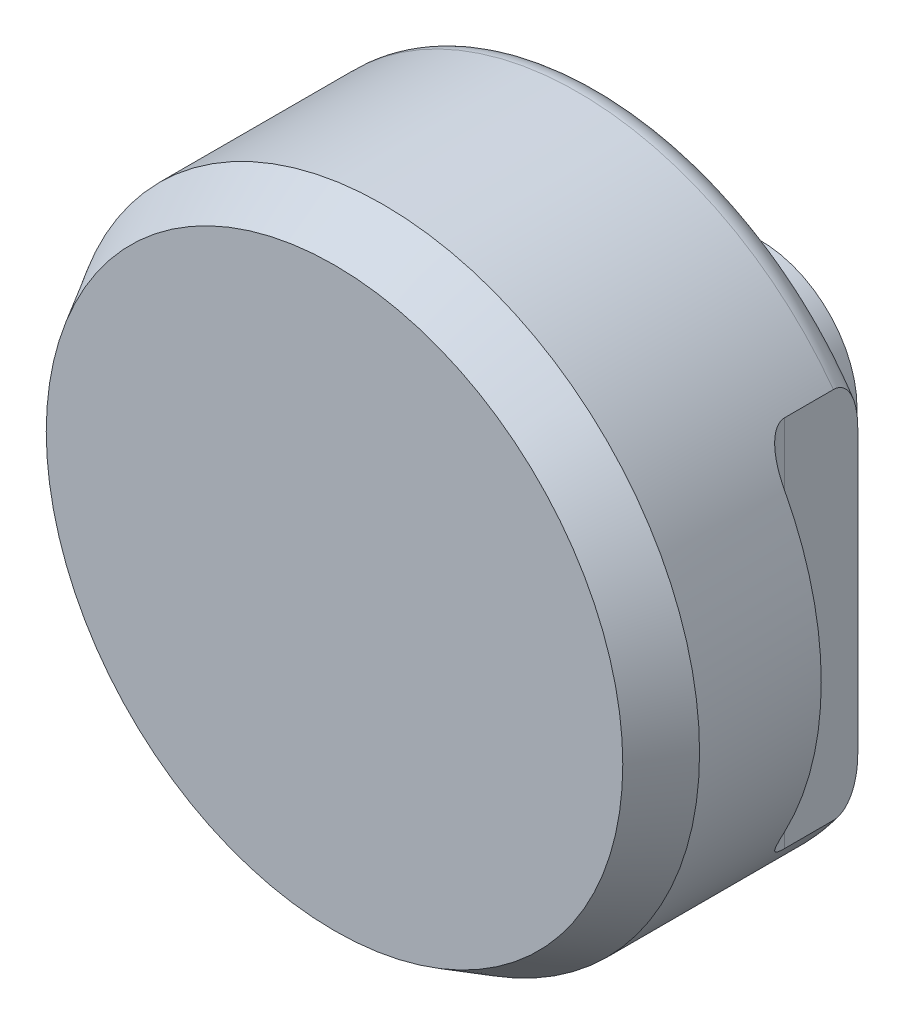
ISO-10303-21;
HEADER;
FILE_DESCRIPTION(('STEP AP214'),'2;1');
FILE_NAME('part.step','',(''),(''),'','','');
FILE_SCHEMA(('AUTOMOTIVE_DESIGN { 1 0 10303 214 1 1 1 1 }'));
ENDSEC;
DATA;
#1=APPLICATION_CONTEXT('core data for automotive mechanical design processes');
#2=APPLICATION_PROTOCOL_DEFINITION('international standard','automotive_design',2000,#1);
#3=PRODUCT_CONTEXT('',#1,'mechanical');
#4=PRODUCT('Part','Part','',(#3));
#5=PRODUCT_RELATED_PRODUCT_CATEGORY('part','',(#4));
#6=PRODUCT_DEFINITION_FORMATION('','',#4);
#7=PRODUCT_DEFINITION_CONTEXT('part definition',#1,'design');
#8=PRODUCT_DEFINITION('design','',#6,#7);
#9=PRODUCT_DEFINITION_SHAPE('','',#8);
#10=(LENGTH_UNIT() NAMED_UNIT(*) SI_UNIT(.MILLI.,.METRE.));
#11=(NAMED_UNIT(*) PLANE_ANGLE_UNIT() SI_UNIT($,.RADIAN.));
#12=(NAMED_UNIT(*) SI_UNIT($,.STERADIAN.) SOLID_ANGLE_UNIT());
#13=UNCERTAINTY_MEASURE_WITH_UNIT(LENGTH_MEASURE(1.E-05),#10,'distance_accuracy_value','');
#14=(GEOMETRIC_REPRESENTATION_CONTEXT(3) GLOBAL_UNCERTAINTY_ASSIGNED_CONTEXT((#13)) GLOBAL_UNIT_ASSIGNED_CONTEXT((#10,
#11,#12)) REPRESENTATION_CONTEXT('',''));
#15=CARTESIAN_POINT('',(0.,0.,0.));
#16=DIRECTION('',(0.,0.,1.));
#17=DIRECTION('',(1.,0.,0.));
#18=AXIS2_PLACEMENT_3D('',#15,#16,#17);
#19=CARTESIAN_POINT('',(0.,0.,-10.));
#20=DIRECTION('',(0.,0.,1.));
#21=DIRECTION('',(1.,0.,0.));
#22=AXIS2_PLACEMENT_3D('',#19,#20,#21);
#23=TOROIDAL_SURFACE('',#22,12.,1.);
#24=CARTESIAN_POINT('',(10.5,-7.47520742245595,-10.457726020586));
#25=CARTESIAN_POINT('',(10.5,-7.41848390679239,-10.5216332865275));
#26=CARTESIAN_POINT('',(10.5,-7.35305485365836,-10.5779857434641));
#27=CARTESIAN_POINT('',(10.5,-7.24793775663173,-10.6523511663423));
#28=CARTESIAN_POINT('',(10.5,-7.21153442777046,-10.6755367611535));
#29=CARTESIAN_POINT('',(10.5,-7.13692517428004,-10.7188130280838));
#30=CARTESIAN_POINT('',(10.5,-7.09872034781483,-10.7389055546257));
#31=CARTESIAN_POINT('',(10.5,-7.00466343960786,-10.784126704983));
#32=CARTESIAN_POINT('',(10.5,-6.94813301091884,-10.8078309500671));
#33=CARTESIAN_POINT('',(10.5,-6.83325568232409,-10.8503332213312));
#34=CARTESIAN_POINT('',(10.5,-6.7749077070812,-10.8691282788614));
#35=CARTESIAN_POINT('',(10.5,-6.59839358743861,-10.9189781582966));
#36=CARTESIAN_POINT('',(10.5,-6.47841173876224,-10.9436518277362));
#37=CARTESIAN_POINT('',(10.5,-6.24822423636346,-10.9776976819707));
#38=CARTESIAN_POINT('',(10.5,-6.13818299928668,-10.9883091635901));
#39=CARTESIAN_POINT('',(10.5,-5.91751450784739,-11.0001598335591));
#40=CARTESIAN_POINT('',(10.5,-5.80688681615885,-11.0013906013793));
#41=CARTESIAN_POINT('',(10.5,-5.58511943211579,-10.9956345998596));
#42=CARTESIAN_POINT('',(10.5,-5.47398140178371,-10.9885916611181));
#43=CARTESIAN_POINT('',(10.5,-5.25252288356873,-10.9669998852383));
#44=CARTESIAN_POINT('',(10.5,-5.14220190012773,-10.9524560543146));
#45=CARTESIAN_POINT('',(10.5,-4.91351068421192,-10.9147665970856));
#46=CARTESIAN_POINT('',(10.5,-4.79524294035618,-10.8910009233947));
#47=CARTESIAN_POINT('',(10.5,-4.56044722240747,-10.8350957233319));
#48=CARTESIAN_POINT('',(10.5,-4.44392273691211,-10.802941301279));
#49=CARTESIAN_POINT('',(10.5,-4.27176907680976,-10.7478895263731));
#50=CARTESIAN_POINT('',(10.5,-4.21501342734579,-10.7284802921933));
#51=CARTESIAN_POINT('',(10.5,-4.10244378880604,-10.6871120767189));
#52=CARTESIAN_POINT('',(10.5,-4.04662958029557,-10.6651536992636));
#53=CARTESIAN_POINT('',(10.5,-3.93640835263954,-10.6183463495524));
#54=CARTESIAN_POINT('',(10.5,-3.88199777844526,-10.5935057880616));
#55=CARTESIAN_POINT('',(10.5,-3.77497856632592,-10.5402390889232));
#56=CARTESIAN_POINT('',(10.5,-3.72236825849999,-10.5118163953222));
#57=CARTESIAN_POINT('',(10.5,-3.64826617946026,-10.467231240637));
#58=CARTESIAN_POINT('',(10.5,-3.62563236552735,-10.4529650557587));
#59=CARTESIAN_POINT('',(10.5,-3.58109460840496,-10.4233070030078));
#60=CARTESIAN_POINT('',(10.5,-3.55919097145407,-10.4079146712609));
#61=CARTESIAN_POINT('',(10.5,-3.51645586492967,-10.3758785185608));
#62=CARTESIAN_POINT('',(10.5,-3.49562023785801,-10.359240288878));
#63=CARTESIAN_POINT('',(10.5,-3.45530238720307,-10.3244103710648));
#64=CARTESIAN_POINT('',(10.5,-3.43581897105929,-10.3062200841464));
#65=CARTESIAN_POINT('',(10.5,-3.40082819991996,-10.2700879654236));
#66=CARTESIAN_POINT('',(10.5,-3.38511964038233,-10.2523435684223));
#67=CARTESIAN_POINT('',(10.5,-3.35582799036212,-10.2151015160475));
#68=CARTESIAN_POINT('',(10.5,-3.34224807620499,-10.1956013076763));
#69=CARTESIAN_POINT('',(10.5,-3.31799495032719,-10.1543869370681));
#70=CARTESIAN_POINT('',(10.5,-3.30737232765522,-10.1326420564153));
#71=CARTESIAN_POINT('',(10.5,-3.29071528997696,-10.0874796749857));
#72=CARTESIAN_POINT('',(10.5,-3.28466072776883,-10.0640700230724));
#73=CARTESIAN_POINT('',(10.5,-3.27913021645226,-10.0232057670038));
#74=CARTESIAN_POINT('',(10.5,-3.27828021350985,-10.0059343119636));
#75=CARTESIAN_POINT('',(10.5,-3.27958547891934,-9.97149816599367));
#76=CARTESIAN_POINT('',(10.5,-3.28174192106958,-9.95433351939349));
#77=CARTESIAN_POINT('',(10.5,-3.28879767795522,-9.92069110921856));
#78=CARTESIAN_POINT('',(10.5,-3.2936822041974,-9.90421015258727));
#79=CARTESIAN_POINT('',(10.5,-3.30572862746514,-9.8721151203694));
#80=CARTESIAN_POINT('',(10.5,-3.31289180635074,-9.85650153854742));
#81=CARTESIAN_POINT('',(10.5,-3.33511987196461,-9.81477236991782));
#82=CARTESIAN_POINT('',(10.5,-3.35205950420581,-9.7896630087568));
#83=CARTESIAN_POINT('',(10.5,-3.38943911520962,-9.74219185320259));
#84=CARTESIAN_POINT('',(10.5,-3.40989235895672,-9.71984104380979));
#85=CARTESIAN_POINT('',(10.5,-3.45914479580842,-9.67143034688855));
#86=CARTESIAN_POINT('',(10.5,-3.48866615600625,-9.64611542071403));
#87=CARTESIAN_POINT('',(10.5,-3.5499771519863,-9.59836177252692));
#88=CARTESIAN_POINT('',(10.5,-3.58177104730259,-9.57592868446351));
#89=CARTESIAN_POINT('',(10.5,-3.64699849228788,-9.53324976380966));
#90=CARTESIAN_POINT('',(10.5,-3.68043919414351,-9.51301497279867));
#91=CARTESIAN_POINT('',(10.5,-3.748348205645,-9.47444035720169));
#92=CARTESIAN_POINT('',(10.5,-3.78281566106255,-9.45609901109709));
#93=CARTESIAN_POINT('',(10.5,-3.86783320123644,-9.41327916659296));
#94=CARTESIAN_POINT('',(10.5,-3.91880455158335,-9.38963869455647));
#95=CARTESIAN_POINT('',(10.5,-4.0219026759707,-9.34501091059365));
#96=CARTESIAN_POINT('',(10.5,-4.074029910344,-9.32402467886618));
#97=CARTESIAN_POINT('',(10.5,-4.23185372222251,-9.26442276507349));
#98=CARTESIAN_POINT('',(10.5,-4.33885064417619,-9.22923191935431));
#99=CARTESIAN_POINT('',(10.5,-4.55520163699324,-9.16644015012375));
#100=CARTESIAN_POINT('',(10.5,-4.66455951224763,-9.1388526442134));
#101=CARTESIAN_POINT('',(10.5,-4.88475198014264,-9.09093090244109));
#102=CARTESIAN_POINT('',(10.5,-4.99558517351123,-9.07059024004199));
#103=CARTESIAN_POINT('',(10.5,-5.22479386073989,-9.03626786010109));
#104=CARTESIAN_POINT('',(10.5,-5.34323507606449,-9.02272155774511));
#105=CARTESIAN_POINT('',(10.5,-5.58089937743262,-9.00445220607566));
#106=CARTESIAN_POINT('',(10.5,-5.70012295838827,-8.9997354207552));
#107=CARTESIAN_POINT('',(10.5,-5.93818361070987,-9.00028655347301));
#108=CARTESIAN_POINT('',(10.5,-6.05702061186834,-9.00552043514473));
#109=CARTESIAN_POINT('',(10.5,-6.29349671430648,-9.02762010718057));
#110=CARTESIAN_POINT('',(10.5,-6.41113724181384,-9.04446984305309));
#111=CARTESIAN_POINT('',(10.5,-6.63920747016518,-9.09144985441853));
#112=CARTESIAN_POINT('',(10.5,-6.7497400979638,-9.12104137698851));
#113=CARTESIAN_POINT('',(10.5,-6.91099112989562,-9.17775579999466));
#114=CARTESIAN_POINT('',(10.5,-6.96390067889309,-9.19867092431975));
#115=CARTESIAN_POINT('',(10.5,-7.06760164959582,-9.24518238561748));
#116=CARTESIAN_POINT('',(10.5,-7.11839493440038,-9.27077449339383));
#117=CARTESIAN_POINT('',(10.5,-7.21469031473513,-9.32601400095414));
#118=CARTESIAN_POINT('',(10.5,-7.26032824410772,-9.35542154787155));
#119=CARTESIAN_POINT('',(10.5,-7.34766587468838,-9.41980401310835));
#120=CARTESIAN_POINT('',(10.5,-7.38936027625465,-9.45478625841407));
#121=CARTESIAN_POINT('',(10.5,-7.46744725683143,-9.53141525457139));
#122=CARTESIAN_POINT('',(10.5,-7.50375341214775,-9.57315196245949));
#123=CARTESIAN_POINT('',(10.5,-7.56737113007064,-9.66298400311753));
#124=CARTESIAN_POINT('',(10.5,-7.59471921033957,-9.71105237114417));
#125=CARTESIAN_POINT('',(10.5,-7.62922283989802,-9.79358872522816));
#126=CARTESIAN_POINT('',(10.5,-7.64010566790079,-9.82650575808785));
#127=CARTESIAN_POINT('',(10.5,-7.65622287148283,-9.89370153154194));
#128=CARTESIAN_POINT('',(10.5,-7.66146160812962,-9.92797919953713));
#129=CARTESIAN_POINT('',(10.5,-7.66586182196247,-9.99701678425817));
#130=CARTESIAN_POINT('',(10.5,-7.66500753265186,-10.0317777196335));
#131=CARTESIAN_POINT('',(10.5,-7.65725982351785,-10.1006238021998));
#132=CARTESIAN_POINT('',(10.5,-7.65036375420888,-10.1347086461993));
#133=CARTESIAN_POINT('',(10.5,-7.63136425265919,-10.2003246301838));
#134=CARTESIAN_POINT('',(10.5,-7.61941256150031,-10.2319006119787));
#135=CARTESIAN_POINT('',(10.5,-7.59109432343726,-10.2929807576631));
#136=CARTESIAN_POINT('',(10.5,-7.57472797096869,-10.3224850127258));
#137=CARTESIAN_POINT('',(10.5,-7.54445435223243,-10.3696925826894));
#138=CARTESIAN_POINT('',(10.5,-7.53154630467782,-10.3880508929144));
#139=CARTESIAN_POINT('',(10.5,-7.50435998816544,-10.4236873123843));
#140=CARTESIAN_POINT('',(10.5,-7.4900830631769,-10.440966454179));
#141=CARTESIAN_POINT('',(10.5,-7.47520742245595,-10.457726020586));
#142=B_SPLINE_CURVE_WITH_KNOTS('',3,(#24,#25,#26,#27,#28,#29,#30,#31,#32,#33,#34,#35,#36,#37,
#38,#39,#40,#41,#42,#43,#44,#45,#46,#47,#48,#49,#50,#51,#52,#53,#54,#55,#56,#57,#58,#59,#60,#61,
#62,#63,#64,#65,#66,#67,#68,#69,#70,#71,#72,#73,#74,#75,#76,#77,#78,#79,#80,#81,#82,#83,#84,#85,
#86,#87,#88,#89,#90,#91,#92,#93,#94,#95,#96,#97,#98,#99,#100,#101,#102,#103,#104,#105,#106,#107,
#108,#109,#110,#111,#112,#113,#114,#115,#116,#117,#118,#119,#120,#121,#122,#123,#124,#125,#126,
#127,#128,#129,#130,#131,#132,#133,#134,#135,#136,#137,#138,#139,#140,#141),.UNSPECIFIED.,.T.,
.F.,(4,2,2,2,2,2,2,2,2,2,2,2,2,2,2,2,2,2,2,2,2,2,2,2,2,2,2,2,2,2,2,2,2,2,2,2,2,2,2,2,2,2,2,2,2,
2,2,2,2,2,2,2,2,2,2,2,2,2,4),(0.,0.256218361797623,0.385643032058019,0.514989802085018,
0.698609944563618,0.882340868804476,1.24867958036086,1.57992787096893,1.91147346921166,
2.24528296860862,2.57886996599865,2.94048465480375,3.30274587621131,3.482647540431,
3.66250667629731,3.84185355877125,4.02102930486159,4.1012680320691,4.18153999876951,
4.26147113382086,4.34133085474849,4.41230739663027,4.4833888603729,4.55562049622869,
4.62753166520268,4.67915551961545,4.73079953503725,4.78216627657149,4.83356196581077,
4.9238989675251,5.01458483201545,5.13098115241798,5.24760167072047,5.36478322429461,
5.48186986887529,5.65032785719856,5.81885418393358,6.15637685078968,6.494491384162,
6.83230532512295,7.18964154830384,7.54723118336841,7.90359987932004,8.25947701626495,
8.60159243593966,8.77209353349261,8.94244121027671,9.10497532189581,9.26772484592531,
9.43285374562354,9.59730086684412,9.70088358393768,9.80438620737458,9.90815675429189,
10.011972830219,10.1128722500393,10.213767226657,10.2810254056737,10.3482182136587),.UNSPECIFIED.);
#143=CARTESIAN_POINT('',(10.5,-7.66485485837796,-9.99999999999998));
#144=VERTEX_POINT('',#143);
#145=CARTESIAN_POINT('',(10.5,-5.80947501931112,-11.));
#146=VERTEX_POINT('',#145);
#147=EDGE_CURVE('E95',#144,#146,#142,.T.);
#148=ORIENTED_EDGE('',*,*,#147,.F.);
#149=CARTESIAN_POINT('',(0.,0.,-10.));
#150=DIRECTION('',(0.,0.,1.));
#151=DIRECTION('',(1.,0.,0.));
#152=AXIS2_PLACEMENT_3D('',#149,#150,#151);
#153=CIRCLE('',#152,13.);
#154=CARTESIAN_POINT('',(-10.5,-7.66485485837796,-10.));
#155=VERTEX_POINT('',#154);
#156=EDGE_CURVE('E120',#155,#144,#153,.T.);
#157=ORIENTED_EDGE('',*,*,#156,.F.);
#158=CARTESIAN_POINT('',(-10.500000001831,-7.47520742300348,-10.4577260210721));
#159=CARTESIAN_POINT('',(-10.5000000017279,-7.50105215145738,-10.4286099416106));
#160=CARTESIAN_POINT('',(-10.5000000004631,-7.52511209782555,-10.3978948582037));
#161=CARTESIAN_POINT('',(-10.499999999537,-7.56858634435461,-10.3332919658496));
#162=CARTESIAN_POINT('',(-10.4999999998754,-7.58800136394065,-10.2994046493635));
#163=CARTESIAN_POINT('',(-10.5000000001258,-7.62110498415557,-10.2284881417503));
#164=CARTESIAN_POINT('',(-10.5000000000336,-7.63473656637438,-10.1914318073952));
#165=CARTESIAN_POINT('',(-10.4999999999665,-7.65477788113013,-10.11541566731));
#166=CARTESIAN_POINT('',(-10.4999999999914,-7.66119644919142,-10.0764582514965));
#167=CARTESIAN_POINT('',(-10.5000000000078,-7.66592651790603,-10.0017146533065));
#168=CARTESIAN_POINT('',(-10.5000000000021,-7.66493915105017,-9.96597208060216));
#169=CARTESIAN_POINT('',(-10.4999999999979,-7.65659209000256,-9.89524155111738));
#170=CARTESIAN_POINT('',(-10.4999999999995,-7.64923100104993,-9.86025376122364));
#171=CARTESIAN_POINT('',(-10.5000000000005,-7.6293107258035,-9.79385768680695));
#172=CARTESIAN_POINT('',(-10.5000000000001,-7.61704968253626,-9.76235801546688));
#173=CARTESIAN_POINT('',(-10.4999999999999,-7.58815494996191,-9.70145680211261));
#174=CARTESIAN_POINT('',(-10.5,-7.57151992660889,-9.67205590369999));
#175=CARTESIAN_POINT('',(-10.5000000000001,-7.52455501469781,-9.60010660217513));
#176=CARTESIAN_POINT('',(-10.5,-7.49171862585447,-9.55919400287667));
#177=CARTESIAN_POINT('',(-10.5,-7.42000296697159,-9.48305413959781));
#178=CARTESIAN_POINT('',(-10.5,-7.38110737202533,-9.44784277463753));
#179=CARTESIAN_POINT('',(-10.5,-7.27546330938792,-9.36385915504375));
#180=CARTESIAN_POINT('',(-10.5,-7.20561242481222,-9.31901566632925));
#181=CARTESIAN_POINT('',(-10.5,-7.06008245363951,-9.24026601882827));
#182=CARTESIAN_POINT('',(-10.5,-6.98439190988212,-9.20638207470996));
#183=CARTESIAN_POINT('',(-10.5,-6.8388256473,-9.15116828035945));
#184=CARTESIAN_POINT('',(-10.5,-6.76932495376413,-9.12882612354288));
#185=CARTESIAN_POINT('',(-10.5,-6.62864084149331,-9.09016420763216));
#186=CARTESIAN_POINT('',(-10.5,-6.55745618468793,-9.07384903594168));
#187=CARTESIAN_POINT('',(-10.5,-6.41395684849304,-9.04643943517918));
#188=CARTESIAN_POINT('',(-10.5,-6.3416401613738,-9.03535571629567));
#189=CARTESIAN_POINT('',(-10.5,-6.19643724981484,-9.01783772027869));
#190=CARTESIAN_POINT('',(-10.5,-6.12355083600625,-9.01140506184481));
#191=CARTESIAN_POINT('',(-10.5,-5.92290278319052,-8.99943879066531));
#192=CARTESIAN_POINT('',(-10.5,-5.79487803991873,-8.99817740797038));
#193=CARTESIAN_POINT('',(-10.5,-5.5391333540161,-9.00649587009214));
#194=CARTESIAN_POINT('',(-10.5,-5.41141378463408,-9.01608537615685));
#195=CARTESIAN_POINT('',(-10.5,-5.15710855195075,-9.0450106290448));
#196=CARTESIAN_POINT('',(-10.5,-5.03052280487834,-9.06434564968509));
#197=CARTESIAN_POINT('',(-10.5,-4.77919291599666,-9.1122782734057));
#198=CARTESIAN_POINT('',(-10.5,-4.65444753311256,-9.14086930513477));
#199=CARTESIAN_POINT('',(-10.5,-4.46757471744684,-9.19145944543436));
#200=CARTESIAN_POINT('',(-10.5,-4.40447302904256,-9.20991141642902));
#201=CARTESIAN_POINT('',(-10.5,-4.27914202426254,-9.2495603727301));
#202=CARTESIAN_POINT('',(-10.5,-4.21691256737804,-9.27075691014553));
#203=CARTESIAN_POINT('',(-10.5,-4.09357636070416,-9.31621542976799));
#204=CARTESIAN_POINT('',(-10.5,-4.03246955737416,-9.34047726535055));
#205=CARTESIAN_POINT('',(-10.5,-3.91184896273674,-9.39261021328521));
#206=CARTESIAN_POINT('',(-10.5,-3.85233424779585,-9.42047917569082));
#207=CARTESIAN_POINT('',(-10.5,-3.73535377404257,-9.48092238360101));
#208=CARTESIAN_POINT('',(-10.5,-3.67789730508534,-9.51351525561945));
#209=CARTESIAN_POINT('',(-10.5,-3.59490050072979,-9.56714859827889));
#210=CARTESIAN_POINT('',(-10.5,-3.56780946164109,-9.58578146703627));
#211=CARTESIAN_POINT('',(-10.5,-3.51509522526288,-9.62500468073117));
#212=CARTESIAN_POINT('',(-10.5,-3.48947065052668,-9.6455931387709));
#213=CARTESIAN_POINT('',(-10.5,-3.44587095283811,-9.68433715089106));
#214=CARTESIAN_POINT('',(-10.5,-3.42746729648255,-9.7020060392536));
#215=CARTESIAN_POINT('',(-10.5,-3.39247224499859,-9.7391462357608));
#216=CARTESIAN_POINT('',(-10.5,-3.37588405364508,-9.75862062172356));
#217=CARTESIAN_POINT('',(-10.5,-3.34520384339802,-9.79991277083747));
#218=CARTESIAN_POINT('',(-10.5,-3.33114930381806,-9.82175908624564));
#219=CARTESIAN_POINT('',(-10.5,-3.30724570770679,-9.86763696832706));
#220=CARTESIAN_POINT('',(-10.5,-3.29737906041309,-9.89165886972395));
#221=CARTESIAN_POINT('',(-10.5,-3.28575195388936,-9.9331425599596));
#222=CARTESIAN_POINT('',(-10.5,-3.28239085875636,-9.95015278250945));
#223=CARTESIAN_POINT('',(-10.5,-3.27862958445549,-9.98449810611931));
#224=CARTESIAN_POINT('',(-10.5,-3.27822724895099,-10.0018329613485));
#225=CARTESIAN_POINT('',(-10.5,-3.28043035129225,-10.0362911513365));
#226=CARTESIAN_POINT('',(-10.5,-3.28303351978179,-10.053414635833));
#227=CARTESIAN_POINT('',(-10.5,-3.29094865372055,-10.0870227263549));
#228=CARTESIAN_POINT('',(-10.5,-3.29626361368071,-10.1035066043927));
#229=CARTESIAN_POINT('',(-10.5,-3.31206119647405,-10.1428799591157));
#230=CARTESIAN_POINT('',(-10.5,-3.32379512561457,-10.1652621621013));
#231=CARTESIAN_POINT('',(-10.5,-3.35055838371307,-10.207952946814));
#232=CARTESIAN_POINT('',(-10.5,-3.36559697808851,-10.2282554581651));
#233=CARTESIAN_POINT('',(-10.5,-3.41213999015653,-10.28411459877));
#234=CARTESIAN_POINT('',(-10.5,-3.44645130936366,-10.3172966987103));
#235=CARTESIAN_POINT('',(-10.5,-3.51908347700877,-10.3788594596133));
#236=CARTESIAN_POINT('',(-10.5,-3.5574169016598,-10.4072242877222));
#237=CARTESIAN_POINT('',(-10.5,-3.65890089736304,-10.4755544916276));
#238=CARTESIAN_POINT('',(-10.5,-3.72376929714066,-10.5129456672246));
#239=CARTESIAN_POINT('',(-10.5,-3.85659648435,-10.5818597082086));
#240=CARTESIAN_POINT('',(-10.5,-3.92456176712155,-10.6133694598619));
#241=CARTESIAN_POINT('',(-10.5,-4.06281021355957,-10.6719691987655));
#242=CARTESIAN_POINT('',(-10.5,-4.13310421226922,-10.6990334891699));
#243=CARTESIAN_POINT('',(-10.5,-4.27498215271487,-10.7492490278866));
#244=CARTESIAN_POINT('',(-10.5,-4.34656485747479,-10.772403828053));
#245=CARTESIAN_POINT('',(-10.5,-4.5545318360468,-10.8342175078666));
#246=CARTESIAN_POINT('',(-10.4999999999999,-4.69223900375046,-10.8684780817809));
#247=CARTESIAN_POINT('',(-10.5000000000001,-4.97012355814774,-10.925677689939));
#248=CARTESIAN_POINT('',(-10.5000000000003,-5.11030373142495,-10.9486029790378));
#249=CARTESIAN_POINT('',(-10.4999999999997,-5.3913286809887,-10.982464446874));
#250=CARTESIAN_POINT('',(-10.499999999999,-5.53216525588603,-10.9934674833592));
#251=CARTESIAN_POINT('',(-10.500000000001,-5.81413192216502,-11.0022504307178));
#252=CARTESIAN_POINT('',(-10.5000000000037,-5.95526131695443,-11.0000490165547));
#253=CARTESIAN_POINT('',(-10.499999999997,-6.20797801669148,-10.9819444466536));
#254=CARTESIAN_POINT('',(-10.49999999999,-6.31976420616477,-10.9689041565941));
#255=CARTESIAN_POINT('',(-10.5000000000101,-6.54149988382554,-10.9307877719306));
#256=CARTESIAN_POINT('',(-10.5000000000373,-6.65144772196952,-10.905701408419));
#257=CARTESIAN_POINT('',(-10.4999999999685,-6.85019848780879,-10.8456459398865));
#258=CARTESIAN_POINT('',(-10.499999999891,-6.93963652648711,-10.8128125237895));
#259=CARTESIAN_POINT('',(-10.5000000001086,-7.11250233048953,-10.7340030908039));
#260=CARTESIAN_POINT('',(-10.5000000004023,-7.1959515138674,-10.6880771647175));
#261=CARTESIAN_POINT('',(-10.49999999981,-7.31048884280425,-10.6085051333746));
#262=CARTESIAN_POINT('',(-10.4999999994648,-7.34596774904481,-10.5811701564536));
#263=CARTESIAN_POINT('',(-10.5000000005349,-7.41348381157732,-10.5225004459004));
#264=CARTESIAN_POINT('',(-10.5000000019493,-7.44552287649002,-10.4911679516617));
#265=CARTESIAN_POINT('',(-10.500000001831,-7.47520742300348,-10.4577260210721));
#266=B_SPLINE_CURVE_WITH_KNOTS('',3,(#158,#159,#160,#161,#162,#163,#164,#165,#166,#167,#168,
#169,#170,#171,#172,#173,#174,#175,#176,#177,#178,#179,#180,#181,#182,#183,#184,#185,#186,#187,
#188,#189,#190,#191,#192,#193,#194,#195,#196,#197,#198,#199,#200,#201,#202,#203,#204,#205,#206,
#207,#208,#209,#210,#211,#212,#213,#214,#215,#216,#217,#218,#219,#220,#221,#222,#223,#224,#225,
#226,#227,#228,#229,#230,#231,#232,#233,#234,#235,#236,#237,#238,#239,#240,#241,#242,#243,#244,
#245,#246,#247,#248,#249,#250,#251,#252,#253,#254,#255,#256,#257,#258,#259,#260,#261,#262,#263,
#264,#265),.UNSPECIFIED.,.T.,.F.,(4,2,2,2,2,2,2,2,2,2,2,2,2,2,2,2,2,2,2,2,2,2,2,2,2,2,2,2,2,2,2,
2,2,2,2,2,2,2,2,2,2,2,2,2,2,2,2,2,2,2,2,2,2,4),(0.,0.116711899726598,0.233405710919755,
0.351224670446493,0.468899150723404,0.575584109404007,0.682292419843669,0.783310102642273,
0.884358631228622,1.04084223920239,1.19775498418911,1.44538298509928,1.69350981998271,
1.91220874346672,2.13107378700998,2.35038498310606,2.56977246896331,2.95327525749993,
3.33711977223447,3.72093568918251,4.10447970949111,4.30166250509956,4.49881316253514,
4.69595439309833,4.8929786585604,5.09080207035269,5.18938008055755,5.28786392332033,
5.36430785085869,5.44088457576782,5.51851476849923,5.59581557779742,5.64760364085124,
5.69935395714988,5.75106522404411,5.80283371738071,5.87821245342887,5.95380529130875,
6.09619893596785,6.23905188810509,6.46312932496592,6.68770056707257,6.91352743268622,
7.13914801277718,7.56430102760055,7.98996832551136,8.41323600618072,8.83590520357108,
9.17304206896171,9.51046684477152,9.79556853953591,10.0795937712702,10.213720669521,
10.3477727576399),.UNSPECIFIED.);
#267=CARTESIAN_POINT('',(-10.5,-5.80947501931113,-11.));
#268=VERTEX_POINT('',#267);
#269=EDGE_CURVE('E119',#268,#155,#266,.T.);
#270=ORIENTED_EDGE('',*,*,#269,.F.);
#271=CARTESIAN_POINT('',(0.,0.,-11.));
#272=DIRECTION('',(0.,0.,1.));
#273=DIRECTION('',(1.,0.,0.));
#274=AXIS2_PLACEMENT_3D('',#271,#272,#273);
#275=CIRCLE('',#274,12.);
#276=EDGE_CURVE('E112',#146,#268,#275,.F.);
#277=ORIENTED_EDGE('',*,*,#276,.F.);
#278=EDGE_LOOP('',(#148,#157,#270,#277));
#279=FACE_BOUND('',#278,.T.);
#280=ADVANCED_FACE('F29',(#279),#23,.T.);
#281=CARTESIAN_POINT('',(0.,0.,-11.));
#282=DIRECTION('',(0.,0.,1.));
#283=DIRECTION('',(1.,0.,0.));
#284=AXIS2_PLACEMENT_3D('',#281,#282,#283);
#285=CYLINDRICAL_SURFACE('',#284,13.);
#286=CARTESIAN_POINT('',(0.,0.,-2.00000000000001));
#287=DIRECTION('',(0.,0.,1.));
#288=DIRECTION('',(1.,0.,0.));
#289=AXIS2_PLACEMENT_3D('',#286,#287,#288);
#290=CIRCLE('',#289,13.);
#291=CARTESIAN_POINT('',(13.,0.,-2.00000000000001));
#292=VERTEX_POINT('',#291);
#293=EDGE_CURVE('E11',#292,#292,#290,.F.);
#294=ORIENTED_EDGE('',*,*,#293,.T.);
#295=EDGE_LOOP('',(#294));
#296=FACE_BOUND('',#295,.T.);
#297=DIRECTION('',(0.,0.,1.));
#298=VECTOR('',#297,1.);
#299=CARTESIAN_POINT('',(10.5,-7.66485485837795,-11.));
#300=LINE('',#299,#298);
#301=CARTESIAN_POINT('',(10.5,-7.66485485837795,-8.));
#302=VERTEX_POINT('',#301);
#303=EDGE_CURVE('E99',#302,#144,#300,.F.);
#304=ORIENTED_EDGE('',*,*,#303,.F.);
#305=CARTESIAN_POINT('',(11.5,-6.06217782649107,-7.));
#306=CARTESIAN_POINT('',(11.4605101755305,-6.13709156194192,-7.00000301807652));
#307=CARTESIAN_POINT('',(11.4202893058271,-6.21161380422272,-7.00233305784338));
#308=CARTESIAN_POINT('',(11.3385562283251,-6.3595814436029,-7.01225904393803));
#309=CARTESIAN_POINT('',(11.2970444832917,-6.43302721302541,-7.01985312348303));
#310=CARTESIAN_POINT('',(11.213156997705,-6.57815372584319,-7.04104980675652));
#311=CARTESIAN_POINT('',(11.170785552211,-6.64984052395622,-7.05462737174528));
#312=CARTESIAN_POINT('',(11.0854608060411,-6.79112291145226,-7.08880845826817));
#313=CARTESIAN_POINT('',(11.0425081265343,-6.860720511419,-7.10940497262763));
#314=CARTESIAN_POINT('',(10.966555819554,-6.98129676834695,-7.15330503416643));
#315=CARTESIAN_POINT('',(10.9335362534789,-7.03288007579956,-7.17490005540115));
#316=CARTESIAN_POINT('',(10.8680258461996,-7.1336964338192,-7.22392955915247));
#317=CARTESIAN_POINT('',(10.8355356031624,-7.18292693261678,-7.25137021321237));
#318=CARTESIAN_POINT('',(10.7716690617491,-7.27835609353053,-7.3133175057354));
#319=CARTESIAN_POINT('',(10.7403042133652,-7.32452627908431,-7.34788076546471));
#320=CARTESIAN_POINT('',(10.6803486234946,-7.41167513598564,-7.42506480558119));
#321=CARTESIAN_POINT('',(10.651751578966,-7.4526656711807,-7.46766659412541));
#322=CARTESIAN_POINT('',(10.6088869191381,-7.51347953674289,-7.54491279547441));
#323=CARTESIAN_POINT('',(10.5931628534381,-7.53561606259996,-7.57691533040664));
#324=CARTESIAN_POINT('',(10.5645425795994,-7.57568768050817,-7.64465629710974));
#325=CARTESIAN_POINT('',(10.5516453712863,-7.59362425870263,-7.68039340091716));
#326=CARTESIAN_POINT('',(10.5295010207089,-7.62430158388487,-7.75569084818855));
#327=CARTESIAN_POINT('',(10.5202994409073,-7.63697753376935,-7.79529185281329));
#328=CARTESIAN_POINT('',(10.5067584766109,-7.65559698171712,-7.87683687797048));
#329=CARTESIAN_POINT('',(10.502410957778,-7.66155174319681,-7.91877685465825));
#330=CARTESIAN_POINT('',(10.4993598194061,-7.6657319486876,-7.99684688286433));
#331=CARTESIAN_POINT('',(10.4999016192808,-7.66499077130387,-8.03289561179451));
#332=CARTESIAN_POINT('',(10.5048050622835,-7.65826923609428,-8.10423415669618));
#333=CARTESIAN_POINT('',(10.5091672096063,-7.65228818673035,-8.13952387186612));
#334=CARTESIAN_POINT('',(10.520937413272,-7.63609630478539,-8.2061876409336));
#335=CARTESIAN_POINT('',(10.5281411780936,-7.62616887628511,-8.23766897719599));
#336=CARTESIAN_POINT('',(10.5450754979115,-7.60273584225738,-8.2985269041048));
#337=CARTESIAN_POINT('',(10.5548067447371,-7.58922925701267,-8.32790291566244));
#338=CARTESIAN_POINT('',(10.5821035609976,-7.55115104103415,-8.39953267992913));
#339=CARTESIAN_POINT('',(10.601061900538,-7.52454298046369,-8.44017343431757));
#340=CARTESIAN_POINT('',(10.6422004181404,-7.46624772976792,-8.51579349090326));
#341=CARTESIAN_POINT('',(10.6643892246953,-7.43454691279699,-8.5507570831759));
#342=CARTESIAN_POINT('',(10.724107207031,-7.34830597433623,-8.63397214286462));
#343=CARTESIAN_POINT('',(10.7631377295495,-7.29109185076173,-8.67834882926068));
#344=CARTESIAN_POINT('',(10.8433837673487,-7.17121187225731,-8.75630014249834));
#345=CARTESIAN_POINT('',(10.8846034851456,-7.10853537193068,-8.78985304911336));
#346=CARTESIAN_POINT('',(10.9628116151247,-6.987227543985,-8.84464545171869));
#347=CARTESIAN_POINT('',(10.9997292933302,-6.92898392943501,-8.86686757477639));
#348=CARTESIAN_POINT('',(11.0734805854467,-6.81049952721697,-8.9054360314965));
#349=CARTESIAN_POINT('',(11.1103141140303,-6.75025725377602,-8.92177788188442));
#350=CARTESIAN_POINT('',(11.1835554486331,-6.62820977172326,-8.94941954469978));
#351=CARTESIAN_POINT('',(11.219962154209,-6.56640144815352,-8.96070831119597));
#352=CARTESIAN_POINT('',(11.2920228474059,-6.4416933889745,-8.97883837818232));
#353=CARTESIAN_POINT('',(11.327676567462,-6.37879327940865,-8.98567812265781));
#354=CARTESIAN_POINT('',(11.4249418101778,-6.20378991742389,-8.99915114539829));
#355=CARTESIAN_POINT('',(11.4855728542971,-6.09081215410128,-9.00163386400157));
#356=CARTESIAN_POINT('',(11.6033872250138,-5.86326340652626,-8.99638668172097));
#357=CARTESIAN_POINT('',(11.6605675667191,-5.74869114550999,-8.98864806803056));
#358=CARTESIAN_POINT('',(11.771113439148,-5.51879860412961,-8.96420920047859));
#359=CARTESIAN_POINT('',(11.824482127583,-5.40347903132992,-8.94751646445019));
#360=CARTESIAN_POINT('',(11.9272549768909,-5.1726726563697,-8.90582951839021));
#361=CARTESIAN_POINT('',(11.9766614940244,-5.05718599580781,-8.88084028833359));
#362=CARTESIAN_POINT('',(12.0689663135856,-4.83259796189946,-8.82405557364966));
#363=CARTESIAN_POINT('',(12.1120692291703,-4.72347593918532,-8.79268009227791));
#364=CARTESIAN_POINT('',(12.1738677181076,-4.56073708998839,-8.73934979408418));
#365=CARTESIAN_POINT('',(12.1939978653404,-4.5066291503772,-8.72052072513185));
#366=CARTESIAN_POINT('',(12.2332641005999,-4.39892377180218,-8.68052291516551));
#367=CARTESIAN_POINT('',(12.252400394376,-4.34532622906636,-8.65935466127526));
#368=CARTESIAN_POINT('',(12.2858811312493,-4.24960642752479,-8.61881777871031));
#369=CARTESIAN_POINT('',(12.3004158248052,-4.20734228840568,-8.59994214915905));
#370=CARTESIAN_POINT('',(12.3287597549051,-4.12354663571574,-8.56013842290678));
#371=CARTESIAN_POINT('',(12.3425691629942,-4.08201495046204,-8.53921081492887));
#372=CARTESIAN_POINT('',(12.3693706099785,-4.00006601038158,-8.49484054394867));
#373=CARTESIAN_POINT('',(12.3823630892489,-3.95964816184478,-8.47139925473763));
#374=CARTESIAN_POINT('',(12.4073678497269,-3.88058397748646,-8.42127266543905));
#375=CARTESIAN_POINT('',(12.4193815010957,-3.84193519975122,-8.39459203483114));
#376=CARTESIAN_POINT('',(12.4399931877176,-3.77459554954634,-8.34212979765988));
#377=CARTESIAN_POINT('',(12.4488109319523,-3.74538947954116,-8.31710377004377));
#378=CARTESIAN_POINT('',(12.4651832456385,-3.69052971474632,-8.26309126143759));
#379=CARTESIAN_POINT('',(12.4727439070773,-3.66485899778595,-8.23412519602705));
#380=CARTESIAN_POINT('',(12.4824173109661,-3.6317198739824,-8.18733613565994));
#381=CARTESIAN_POINT('',(12.4853245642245,-3.62170653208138,-8.17150385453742));
#382=CARTESIAN_POINT('',(12.4904968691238,-3.60382761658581,-8.1385439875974));
#383=CARTESIAN_POINT('',(12.4927620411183,-3.59596164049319,-8.12141664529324));
#384=CARTESIAN_POINT('',(12.4964801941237,-3.58301966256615,-8.08574356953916));
#385=CARTESIAN_POINT('',(12.4979214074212,-3.57798410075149,-8.06718138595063));
#386=CARTESIAN_POINT('',(12.4997456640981,-3.57160617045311,-8.02939129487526));
#387=CARTESIAN_POINT('',(12.5001309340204,-3.57025603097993,-8.01016487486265));
#388=CARTESIAN_POINT('',(12.4998124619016,-3.57137057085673,-7.97456241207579));
#389=CARTESIAN_POINT('',(12.4992545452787,-3.57332443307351,-7.95816653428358));
#390=CARTESIAN_POINT('',(12.497385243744,-3.57985662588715,-7.92594751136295));
#391=CARTESIAN_POINT('',(12.4960729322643,-3.58443818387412,-7.9101250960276));
#392=CARTESIAN_POINT('',(12.4922019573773,-3.59790977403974,-7.87354761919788));
#393=CARTESIAN_POINT('',(12.489359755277,-3.60777353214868,-7.85318674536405));
#394=CARTESIAN_POINT('',(12.4828055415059,-3.6303864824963,-7.81430152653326));
#395=CARTESIAN_POINT('',(12.479091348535,-3.64314290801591,-7.79578195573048));
#396=CARTESIAN_POINT('',(12.4675549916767,-3.6824955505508,-7.74506356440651));
#397=CARTESIAN_POINT('',(12.4589646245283,-3.71149671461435,-7.71493755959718));
#398=CARTESIAN_POINT('',(12.4404979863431,-3.77293792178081,-7.65893006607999));
#399=CARTESIAN_POINT('',(12.4306173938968,-3.80538945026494,-7.63306353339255));
#400=CARTESIAN_POINT('',(12.4037224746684,-3.89240193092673,-7.56977959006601));
#401=CARTESIAN_POINT('',(12.3859983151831,-3.9484982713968,-7.53479875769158));
#402=CARTESIAN_POINT('',(12.348864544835,-4.06315320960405,-7.47008778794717));
#403=CARTESIAN_POINT('',(12.3294511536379,-4.1217171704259,-7.4403699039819));
#404=CARTESIAN_POINT('',(12.2891049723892,-4.24050109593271,-7.384778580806));
#405=CARTESIAN_POINT('',(12.2681652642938,-4.30072771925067,-7.35892450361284));
#406=CARTESIAN_POINT('',(12.2249992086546,-4.42193781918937,-7.31048921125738));
#407=CARTESIAN_POINT('',(12.2027741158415,-4.48292051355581,-7.28790487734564));
#408=CARTESIAN_POINT('',(12.1564779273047,-4.60701033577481,-7.24497735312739));
#409=CARTESIAN_POINT('',(12.1323735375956,-4.6701309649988,-7.22470932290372));
#410=CARTESIAN_POINT('',(12.0828988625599,-4.79668384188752,-7.18685969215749));
#411=CARTESIAN_POINT('',(12.0575283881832,-4.86011613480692,-7.16927849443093));
#412=CARTESIAN_POINT('',(11.9795093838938,-5.05076274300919,-7.12030964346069));
#413=CARTESIAN_POINT('',(11.9249940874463,-5.17821706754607,-7.09273386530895));
#414=CARTESIAN_POINT('',(11.8113013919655,-5.43254524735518,-7.0477315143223));
#415=CARTESIAN_POINT('',(11.7521322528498,-5.55941972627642,-7.03028740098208));
#416=CARTESIAN_POINT('',(11.6293128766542,-5.81194886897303,-7.00642463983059));
#417=CARTESIAN_POINT('',(11.5656671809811,-5.93760462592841,-6.9999949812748));
#418=CARTESIAN_POINT('',(11.5,-6.06217782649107,-7.));
#419=B_SPLINE_CURVE_WITH_KNOTS('',3,(#305,#306,#307,#308,#309,#310,#311,#312,#313,#314,#315,
#316,#317,#318,#319,#320,#321,#322,#323,#324,#325,#326,#327,#328,#329,#330,#331,#332,#333,#334,
#335,#336,#337,#338,#339,#340,#341,#342,#343,#344,#345,#346,#347,#348,#349,#350,#351,#352,#353,
#354,#355,#356,#357,#358,#359,#360,#361,#362,#363,#364,#365,#366,#367,#368,#369,#370,#371,#372,
#373,#374,#375,#376,#377,#378,#379,#380,#381,#382,#383,#384,#385,#386,#387,#388,#389,#390,#391,
#392,#393,#394,#395,#396,#397,#398,#399,#400,#401,#402,#403,#404,#405,#406,#407,#408,#409,#410,
#411,#412,#413,#414,#415,#416,#417,#418),.UNSPECIFIED.,.T.,.F.,(4,2,2,2,2,2,2,2,2,2,2,2,2,2,2,2,
2,2,2,2,2,2,2,2,2,2,2,2,2,2,2,2,2,2,2,2,2,2,2,2,2,2,2,2,2,2,2,2,2,2,2,2,2,2,2,2,4),(0.,
0.254000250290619,0.507910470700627,0.760768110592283,1.01337405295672,1.20795629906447,
1.40274500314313,1.59914644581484,1.7950895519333,1.92061973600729,2.04610543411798,
2.1730939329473,2.29986930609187,2.40745827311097,2.51506144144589,2.61603291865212,
2.71703206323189,2.8725757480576,3.02854277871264,3.27393231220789,3.5198112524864,
3.73685256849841,3.95405901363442,4.1717379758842,4.38949302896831,4.77362291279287,
5.15808044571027,5.54221569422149,5.92612078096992,6.29012376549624,6.47225448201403,
6.65434734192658,6.799852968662,6.94532402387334,7.09071597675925,7.23590078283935,
7.35408516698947,7.47167897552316,7.5284182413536,7.58514686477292,7.64266664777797,
7.70006505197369,7.74937412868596,7.79874389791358,7.86676108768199,7.93495027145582,
8.06230297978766,8.19009373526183,8.39491924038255,8.60021553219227,8.80650837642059,
9.01260313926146,9.22415401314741,9.43573657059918,9.85926905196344,10.2820660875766,
10.7044402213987),.UNSPECIFIED.);
#420=CARTESIAN_POINT('',(11.5,-6.06217782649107,-7.));
#421=VERTEX_POINT('',#420);
#422=EDGE_CURVE('E181',#421,#302,#419,.T.);
#423=ORIENTED_EDGE('',*,*,#422,.F.);
#424=CARTESIAN_POINT('',(0.,0.,-7.));
#425=DIRECTION('',(0.,0.,1.));
#426=DIRECTION('',(1.,0.,0.));
#427=AXIS2_PLACEMENT_3D('',#424,#425,#426);
#428=CIRCLE('',#427,13.);
#429=CARTESIAN_POINT('',(11.5,6.06217782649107,-7.));
#430=VERTEX_POINT('',#429);
#431=EDGE_CURVE('E171',#430,#421,#428,.F.);
#432=ORIENTED_EDGE('',*,*,#431,.F.);
#433=CARTESIAN_POINT('',(11.5,6.06217782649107,-7.));
#434=CARTESIAN_POINT('',(11.5649526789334,5.93896030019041,-6.99999550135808));
#435=CARTESIAN_POINT('',(11.627939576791,5.81465983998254,-7.00628794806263));
#436=CARTESIAN_POINT('',(11.749546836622,5.56484494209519,-7.02965909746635));
#437=CARTESIAN_POINT('',(11.8081618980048,5.43932923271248,-7.04675066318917));
#438=CARTESIAN_POINT('',(11.9207692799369,5.18789171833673,-7.09081562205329));
#439=CARTESIAN_POINT('',(11.9747602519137,5.06196980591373,-7.11779188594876));
#440=CARTESIAN_POINT('',(12.0520896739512,4.87357648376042,-7.16566788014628));
#441=CARTESIAN_POINT('',(12.0772478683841,4.81088378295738,-7.18285395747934));
#442=CARTESIAN_POINT('',(12.1263305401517,4.68578890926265,-7.21983611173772));
#443=CARTESIAN_POINT('',(12.1502551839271,4.62338669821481,-7.23963183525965));
#444=CARTESIAN_POINT('',(12.2006597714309,4.48886109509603,-7.28556106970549));
#445=CARTESIAN_POINT('',(12.2269136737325,4.41682511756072,-7.31220150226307));
#446=CARTESIAN_POINT('',(12.2776463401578,4.27377546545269,-7.3701114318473));
#447=CARTESIAN_POINT('',(12.3021215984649,4.20276401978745,-7.4013897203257));
#448=CARTESIAN_POINT('',(12.3373818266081,4.09760899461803,-7.45298378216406));
#449=CARTESIAN_POINT('',(12.3489434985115,4.06262472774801,-7.47105645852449));
#450=CARTESIAN_POINT('',(12.3714735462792,3.99348979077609,-7.50905864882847));
#451=CARTESIAN_POINT('',(12.3824421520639,3.95933880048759,-7.52898743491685));
#452=CARTESIAN_POINT('',(12.4036535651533,3.89237815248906,-7.57108918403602));
#453=CARTESIAN_POINT('',(12.4138987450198,3.85956427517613,-7.59325417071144));
#454=CARTESIAN_POINT('',(12.4335147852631,3.79589396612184,-7.64054530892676));
#455=CARTESIAN_POINT('',(12.442887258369,3.76503395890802,-7.66566579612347));
#456=CARTESIAN_POINT('',(12.4576378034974,3.71587115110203,-7.71136769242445));
#457=CARTESIAN_POINT('',(12.4633425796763,3.69668049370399,-7.73087720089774));
#458=CARTESIAN_POINT('',(12.4739509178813,3.66072346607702,-7.7722386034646));
#459=CARTESIAN_POINT('',(12.4788557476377,3.64395326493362,-7.79408669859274));
#460=CARTESIAN_POINT('',(12.4861492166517,3.61886632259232,-7.83334174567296));
#461=CARTESIAN_POINT('',(12.4888470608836,3.60953862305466,-7.85003528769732));
#462=CARTESIAN_POINT('',(12.493486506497,3.59344753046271,-7.88472211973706));
#463=CARTESIAN_POINT('',(12.4954294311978,3.5866796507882,-7.90271306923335));
#464=CARTESIAN_POINT('',(12.498100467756,3.5773599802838,-7.9365110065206));
#465=CARTESIAN_POINT('',(12.4989804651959,3.57428180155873,-7.95215831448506));
#466=CARTESIAN_POINT('',(12.499992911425,3.57073955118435,-7.98376797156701));
#467=CARTESIAN_POINT('',(12.5001259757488,3.57027332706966,-7.99973005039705));
#468=CARTESIAN_POINT('',(12.4996304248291,3.5720078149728,-8.03148434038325));
#469=CARTESIAN_POINT('',(12.499002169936,3.57420726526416,-8.0472766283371));
#470=CARTESIAN_POINT('',(12.4970523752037,3.5810185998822,-8.07828711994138));
#471=CARTESIAN_POINT('',(12.4957300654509,3.58563316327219,-8.09350466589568));
#472=CARTESIAN_POINT('',(12.4917837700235,3.59936219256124,-8.12972905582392));
#473=CARTESIAN_POINT('',(12.4888421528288,3.60956605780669,-8.15028365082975));
#474=CARTESIAN_POINT('',(12.4820816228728,3.63287591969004,-8.18950963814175));
#475=CARTESIAN_POINT('',(12.4782602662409,3.64598999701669,-8.20817557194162));
#476=CARTESIAN_POINT('',(12.4663415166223,3.68660831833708,-8.25957812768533));
#477=CARTESIAN_POINT('',(12.4574525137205,3.71657764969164,-8.29014996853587));
#478=CARTESIAN_POINT('',(12.4383652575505,3.77997206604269,-8.34693317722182));
#479=CARTESIAN_POINT('',(12.4281628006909,3.8134081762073,-8.373129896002));
#480=CARTESIAN_POINT('',(12.4002905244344,3.90335127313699,-8.43744901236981));
#481=CARTESIAN_POINT('',(12.3818790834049,3.96142897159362,-8.47302950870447));
#482=CARTESIAN_POINT('',(12.3433001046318,4.08005809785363,-8.53877911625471));
#483=CARTESIAN_POINT('',(12.3231286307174,4.14061490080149,-8.56893561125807));
#484=CARTESIAN_POINT('',(12.2811797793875,4.26343220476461,-8.62529826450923));
#485=CARTESIAN_POINT('',(12.259394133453,4.32570027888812,-8.65148164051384));
#486=CARTESIAN_POINT('',(12.2144667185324,4.45098104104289,-8.70045556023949));
#487=CARTESIAN_POINT('',(12.1913262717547,4.51399295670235,-8.72324933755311));
#488=CARTESIAN_POINT('',(12.1430534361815,4.64231459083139,-8.7665263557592));
#489=CARTESIAN_POINT('',(12.1178830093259,4.70763849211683,-8.78692488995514));
#490=CARTESIAN_POINT('',(12.0661969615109,4.83857939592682,-8.82489229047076));
#491=CARTESIAN_POINT('',(12.0396811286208,4.90419644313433,-8.84246070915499));
#492=CARTESIAN_POINT('',(11.9581016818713,5.10137548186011,-8.89116178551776));
#493=CARTESIAN_POINT('',(11.901052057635,5.23314289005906,-8.91824980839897));
#494=CARTESIAN_POINT('',(11.7822187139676,5.49544909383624,-8.96141538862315));
#495=CARTESIAN_POINT('',(11.7204624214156,5.62599067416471,-8.97755201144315));
#496=CARTESIAN_POINT('',(11.5922750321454,5.88558057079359,-8.99784548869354));
#497=CARTESIAN_POINT('',(11.5258498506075,6.01463054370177,-9.00201723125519));
#498=CARTESIAN_POINT('',(11.4015214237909,6.24654220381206,-8.99670439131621));
#499=CARTESIAN_POINT('',(11.3443163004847,6.34983027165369,-8.98960441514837));
#500=CARTESIAN_POINT('',(11.2275373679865,6.55410020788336,-8.96403085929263));
#501=CARTESIAN_POINT('',(11.1679583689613,6.6550761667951,-8.94553091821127));
#502=CARTESIAN_POINT('',(11.0774579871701,6.80392342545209,-8.90694241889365));
#503=CARTESIAN_POINT('',(11.0469067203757,6.85340587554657,-8.89214510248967));
#504=CARTESIAN_POINT('',(10.985779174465,6.95096851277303,-8.85837008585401));
#505=CARTESIAN_POINT('',(10.9552028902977,6.99904804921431,-8.83939047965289));
#506=CARTESIAN_POINT('',(10.8945628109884,7.0930681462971,-8.7967516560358));
#507=CARTESIAN_POINT('',(10.8644972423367,7.13901800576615,-8.77311574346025));
#508=CARTESIAN_POINT('',(10.805311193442,7.22828523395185,-8.72040037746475));
#509=CARTESIAN_POINT('',(10.7761894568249,7.27160617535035,-8.69132854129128));
#510=CARTESIAN_POINT('',(10.7247367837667,7.34722582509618,-8.63261874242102));
#511=CARTESIAN_POINT('',(10.7021192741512,7.38011452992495,-8.60400112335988));
#512=CARTESIAN_POINT('',(10.6587622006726,7.44259583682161,-8.54198773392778));
#513=CARTESIAN_POINT('',(10.6380241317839,7.47218581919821,-8.50858821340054));
#514=CARTESIAN_POINT('',(10.5992152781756,7.52713624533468,-8.43622677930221));
#515=CARTESIAN_POINT('',(10.5811803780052,7.55244028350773,-8.39720159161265));
#516=CARTESIAN_POINT('',(10.5495500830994,7.59656067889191,-8.31401671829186));
#517=CARTESIAN_POINT('',(10.5359418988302,7.61539573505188,-8.2698723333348));
#518=CARTESIAN_POINT('',(10.5179974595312,7.64014971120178,-8.19170810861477));
#519=CARTESIAN_POINT('',(10.5120973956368,7.64825852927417,-8.15873845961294));
#520=CARTESIAN_POINT('',(10.5036292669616,7.65988416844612,-8.09157999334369));
#521=CARTESIAN_POINT('',(10.5010587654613,7.66340434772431,-8.05739208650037));
#522=CARTESIAN_POINT('',(10.4994726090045,7.66557741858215,-7.98870803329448));
#523=CARTESIAN_POINT('',(10.5004641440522,7.66422046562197,-7.95421140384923));
#524=CARTESIAN_POINT('',(10.5059273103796,7.65672983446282,-7.88602324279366));
#525=CARTESIAN_POINT('',(10.5104002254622,7.65059439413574,-7.8523320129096));
#526=CARTESIAN_POINT('',(10.5223480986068,7.63415284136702,-7.78722224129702));
#527=CARTESIAN_POINT('',(10.5297683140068,7.62392275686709,-7.75577395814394));
#528=CARTESIAN_POINT('',(10.5471160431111,7.59990546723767,-7.69502095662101));
#529=CARTESIAN_POINT('',(10.5570445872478,7.58611680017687,-7.66571712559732));
#530=CARTESIAN_POINT('',(10.5849498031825,7.54716354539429,-7.59394979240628));
#531=CARTESIAN_POINT('',(10.6043420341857,7.51992320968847,-7.55316259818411));
#532=CARTESIAN_POINT('',(10.6463353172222,7.46035422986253,-7.4773683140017));
#533=CARTESIAN_POINT('',(10.6689446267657,7.42801246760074,-7.44237661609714));
#534=CARTESIAN_POINT('',(10.7298533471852,7.33992561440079,-7.35900065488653));
#535=CARTESIAN_POINT('',(10.769655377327,7.28147547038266,-7.31459890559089));
#536=CARTESIAN_POINT('',(10.8514071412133,7.15908046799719,-7.23677021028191));
#537=CARTESIAN_POINT('',(10.8933620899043,7.09512198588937,-7.20337152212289));
#538=CARTESIAN_POINT('',(10.9730115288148,6.97121309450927,-7.14892479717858));
#539=CARTESIAN_POINT('',(11.0106442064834,6.91164146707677,-7.12690083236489));
#540=CARTESIAN_POINT('',(11.0857722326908,6.79048904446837,-7.0888523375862));
#541=CARTESIAN_POINT('',(11.1232674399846,6.72890660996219,-7.07283284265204));
#542=CARTESIAN_POINT('',(11.1976782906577,6.60433686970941,-7.04597463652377));
#543=CARTESIAN_POINT('',(11.2345941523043,6.54135011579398,-7.03513392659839));
#544=CARTESIAN_POINT('',(11.3076132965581,6.41430051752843,-7.01796443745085));
#545=CARTESIAN_POINT('',(11.3437164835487,6.35023754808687,-7.0116361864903));
#546=CARTESIAN_POINT('',(11.3997819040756,6.24874100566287,-7.0048213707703));
#547=CARTESIAN_POINT('',(11.4200766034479,6.21157336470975,-7.00299493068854));
#548=CARTESIAN_POINT('',(11.4603080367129,6.13702974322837,-7.00058523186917));
#549=CARTESIAN_POINT('',(11.4802449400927,6.09965387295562,-7.00000136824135));
#550=CARTESIAN_POINT('',(11.5,6.06217782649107,-7.));
#551=B_SPLINE_CURVE_WITH_KNOTS('',3,(#433,#434,#435,#436,#437,#438,#439,#440,#441,#442,#443,
#444,#445,#446,#447,#448,#449,#450,#451,#452,#453,#454,#455,#456,#457,#458,#459,#460,#461,#462,
#463,#464,#465,#466,#467,#468,#469,#470,#471,#472,#473,#474,#475,#476,#477,#478,#479,#480,#481,
#482,#483,#484,#485,#486,#487,#488,#489,#490,#491,#492,#493,#494,#495,#496,#497,#498,#499,#500,
#501,#502,#503,#504,#505,#506,#507,#508,#509,#510,#511,#512,#513,#514,#515,#516,#517,#518,#519,
#520,#521,#522,#523,#524,#525,#526,#527,#528,#529,#530,#531,#532,#533,#534,#535,#536,#537,#538,
#539,#540,#541,#542,#543,#544,#545,#546,#547,#548,#549,#550),.UNSPECIFIED.,.T.,.F.,(4,2,2,2,2,2,
2,2,2,2,2,2,2,2,2,2,2,2,2,2,2,2,2,2,2,2,2,2,2,2,2,2,2,2,2,2,2,2,2,2,2,2,2,2,2,2,2,2,2,2,2,2,2,2,
2,2,2,2,4),(0.,0.417825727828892,0.836150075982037,1.25459601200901,1.46366181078,
1.6726993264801,1.91608342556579,2.15993492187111,2.283011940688,2.40604089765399,
2.52864557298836,2.65101898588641,2.73474596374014,2.81833893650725,2.87610495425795,
2.9337692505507,2.98147113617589,3.02913370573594,3.07677372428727,3.1244667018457,
3.19347516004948,3.26267768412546,3.39311610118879,3.5239828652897,3.73512554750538,
3.94675316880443,4.15955181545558,4.37214613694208,4.59081953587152,4.80952748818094,
5.24735291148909,5.68279778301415,6.11770058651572,6.47211175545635,6.82734555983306,
7.00724030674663,7.18721720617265,7.3663152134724,7.54516411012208,7.69220312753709,
7.83935809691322,7.98832026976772,8.13684816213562,8.23979669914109,8.34266985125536,
8.44575077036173,8.54886971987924,8.65015676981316,8.75148549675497,8.90880808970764,
9.06654203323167,9.31563972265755,9.56537224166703,9.78652930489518,10.007871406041,
10.2291280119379,10.4504105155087,10.5775522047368,10.7046319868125),.UNSPECIFIED.);
#552=CARTESIAN_POINT('',(10.5,7.66485485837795,-8.));
#553=VERTEX_POINT('',#552);
#554=EDGE_CURVE('E104',#553,#430,#551,.T.);
#555=ORIENTED_EDGE('',*,*,#554,.F.);
#556=DIRECTION('',(0.,0.,1.));
#557=VECTOR('',#556,1.);
#558=CARTESIAN_POINT('',(10.5,7.66485485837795,-11.));
#559=LINE('',#558,#557);
#560=CARTESIAN_POINT('',(10.5,7.66485485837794,-9.99999999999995));
#561=VERTEX_POINT('',#560);
#562=EDGE_CURVE('E212',#561,#553,#559,.T.);
#563=ORIENTED_EDGE('',*,*,#562,.F.);
#564=CARTESIAN_POINT('',(-10.5,7.66485485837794,-10.));
#565=VERTEX_POINT('',#564);
#566=EDGE_CURVE('E53',#561,#565,#153,.T.);
#567=ORIENTED_EDGE('',*,*,#566,.T.);
#568=DIRECTION('',(0.,0.,1.));
#569=VECTOR('',#568,1.);
#570=CARTESIAN_POINT('',(-10.5,7.66485485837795,-11.));
#571=LINE('',#570,#569);
#572=CARTESIAN_POINT('',(-10.5,7.66485485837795,-8.));
#573=VERTEX_POINT('',#572);
#574=EDGE_CURVE('E226',#573,#565,#571,.F.);
#575=ORIENTED_EDGE('',*,*,#574,.F.);
#576=CARTESIAN_POINT('',(-11.5,6.06217782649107,-7.));
#577=CARTESIAN_POINT('',(-11.4605291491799,6.1370544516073,-7.00000026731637));
#578=CARTESIAN_POINT('',(-11.4203250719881,6.21154721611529,-7.00233027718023));
#579=CARTESIAN_POINT('',(-11.3386333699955,6.35944362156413,-7.01224811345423));
#580=CARTESIAN_POINT('',(-11.297146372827,6.43284776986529,-7.01983340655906));
#581=CARTESIAN_POINT('',(-11.2132636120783,6.57797243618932,-7.04101687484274));
#582=CARTESIAN_POINT('',(-11.1708710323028,6.64969743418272,-7.05459650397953));
#583=CARTESIAN_POINT('',(-11.0855036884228,6.79105344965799,-7.08878790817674));
#584=CARTESIAN_POINT('',(-11.0425295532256,6.86068650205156,-7.10939259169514));
#585=CARTESIAN_POINT('',(-10.9665522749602,6.98130239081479,-7.15330708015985));
#586=CARTESIAN_POINT('',(-10.9335291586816,7.03289115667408,-7.17490469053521));
#587=CARTESIAN_POINT('',(-10.8680188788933,7.13370699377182,-7.22393544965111));
#588=CARTESIAN_POINT('',(-10.8355321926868,7.18293202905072,-7.25137352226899));
#589=CARTESIAN_POINT('',(-10.7716700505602,7.27835461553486,-7.31331654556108));
#590=CARTESIAN_POINT('',(-10.7403061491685,7.32452343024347,-7.34787863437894));
#591=CARTESIAN_POINT('',(-10.6803503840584,7.41167261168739,-7.42506217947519));
#592=CARTESIAN_POINT('',(-10.651752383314,7.45266452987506,-7.4676651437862));
#593=CARTESIAN_POINT('',(-10.6088867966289,7.51347971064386,-7.54491301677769));
#594=CARTESIAN_POINT('',(-10.5931626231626,7.53561638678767,-7.57691579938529));
#595=CARTESIAN_POINT('',(-10.5645423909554,7.57568794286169,-7.64465681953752));
#596=CARTESIAN_POINT('',(-10.5516452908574,7.59362437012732,-7.68039367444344));
#597=CARTESIAN_POINT('',(-10.5295010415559,7.62430155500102,-7.75569077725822));
#598=CARTESIAN_POINT('',(-10.5202994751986,7.63697748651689,-7.79529170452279));
#599=CARTESIAN_POINT('',(-10.5067584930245,7.65559695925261,-7.87683672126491));
#600=CARTESIAN_POINT('',(-10.5024109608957,7.66155173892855,-7.91877677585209));
#601=CARTESIAN_POINT('',(-10.499359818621,7.66573194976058,-7.99684690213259));
#602=CARTESIAN_POINT('',(-10.4999016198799,7.66499077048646,-8.03289565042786));
#603=CARTESIAN_POINT('',(-10.5048050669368,7.65826922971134,-8.10423419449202));
#604=CARTESIAN_POINT('',(-10.5091672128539,7.65228818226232,-8.13952389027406));
#605=CARTESIAN_POINT('',(-10.5209374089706,7.63609631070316,-8.20618761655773));
#606=CARTESIAN_POINT('',(-10.5281411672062,7.62616889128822,-8.23766892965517));
#607=CARTESIAN_POINT('',(-10.5450754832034,7.60273586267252,-8.298526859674));
#608=CARTESIAN_POINT('',(-10.5548067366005,7.58922926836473,-8.32790289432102));
#609=CARTESIAN_POINT('',(-10.5821036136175,7.55115096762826,-8.39953281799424));
#610=CARTESIAN_POINT('',(-10.6010620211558,7.52454281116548,-8.44017369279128));
#611=CARTESIAN_POINT('',(-10.6422005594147,7.46624752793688,-8.51579371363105));
#612=CARTESIAN_POINT('',(-10.664389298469,7.43454680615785,-8.55075718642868));
#613=CARTESIAN_POINT('',(-10.7241066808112,7.34830673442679,-8.63397140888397));
#614=CARTESIAN_POINT('',(-10.7631366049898,7.2910935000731,-8.67834754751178));
#615=CARTESIAN_POINT('',(-10.8433825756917,7.17121368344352,-8.75629917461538));
#616=CARTESIAN_POINT('',(-10.884602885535,7.10853630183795,-8.78985262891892));
#617=CARTESIAN_POINT('',(-10.9628139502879,6.98722392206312,-8.8446470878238));
#618=CARTESIAN_POINT('',(-10.9997339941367,6.92897651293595,-8.86687040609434));
#619=CARTESIAN_POINT('',(-11.0734899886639,6.81048428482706,-8.90544057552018));
#620=CARTESIAN_POINT('',(-11.1103258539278,6.75023797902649,-8.92178294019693));
#621=CARTESIAN_POINT('',(-11.1835670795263,6.62819010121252,-8.94942330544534));
#622=CARTESIAN_POINT('',(-11.2199714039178,6.56638559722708,-8.96071090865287));
#623=CARTESIAN_POINT('',(-11.2920274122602,6.44168533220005,-8.97883925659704));
#624=CARTESIAN_POINT('',(-11.3276788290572,6.37878919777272,-8.98567844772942));
#625=CARTESIAN_POINT('',(-11.4249255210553,6.20381924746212,-8.99914886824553));
#626=CARTESIAN_POINT('',(-11.4855409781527,6.09087165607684,-9.00163244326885));
#627=CARTESIAN_POINT('',(-11.6033269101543,5.86338196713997,-8.99639220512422));
#628=CARTESIAN_POINT('',(-11.6604943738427,5.74883858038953,-8.98865960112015));
#629=CARTESIAN_POINT('',(-11.7710446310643,5.51894646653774,-8.96422905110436));
#630=CARTESIAN_POINT('',(-11.8244285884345,5.40359799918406,-8.94753387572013));
#631=CARTESIAN_POINT('',(-11.9272324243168,5.1727245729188,-8.90584296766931));
#632=CARTESIAN_POINT('',(-11.9766547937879,5.05719977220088,-8.88085250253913));
#633=CARTESIAN_POINT('',(-12.0590917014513,4.85662587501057,-8.83012432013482));
#634=CARTESIAN_POINT('',(-12.0930280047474,4.77147313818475,-8.80627514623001));
#635=CARTESIAN_POINT('',(-12.1585470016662,4.60195258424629,-8.75371202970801));
#636=CARTESIAN_POINT('',(-12.1901341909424,4.51758355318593,-8.72500774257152));
#637=CARTESIAN_POINT('',(-12.243139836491,4.37149044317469,-8.66993011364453));
#638=CARTESIAN_POINT('',(-12.2650958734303,4.30948310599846,-8.64483196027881));
#639=CARTESIAN_POINT('',(-12.3076185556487,4.18649862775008,-8.590712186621));
#640=CARTESIAN_POINT('',(-12.32818152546,4.12552450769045,-8.56168075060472));
#641=CARTESIAN_POINT('',(-12.3678164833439,4.00513857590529,-8.49831503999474));
#642=CARTESIAN_POINT('',(-12.3868760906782,3.94574196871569,-8.46394251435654));
#643=CARTESIAN_POINT('',(-12.4137710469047,3.85994735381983,-8.40676461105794));
#644=CARTESIAN_POINT('',(-12.4224439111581,3.83193191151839,-8.38679702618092));
#645=CARTESIAN_POINT('',(-12.4390796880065,3.77757821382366,-8.34445524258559));
#646=CARTESIAN_POINT('',(-12.4470436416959,3.75123751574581,-8.32208468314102));
#647=CARTESIAN_POINT('',(-12.4604676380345,3.70636997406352,-8.27910375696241));
#648=CARTESIAN_POINT('',(-12.4661062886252,3.6873482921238,-8.25907275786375));
#649=CARTESIAN_POINT('',(-12.476514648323,3.65197462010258,-8.21655724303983));
#650=CARTESIAN_POINT('',(-12.4812862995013,3.63561667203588,-8.19407839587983));
#651=CARTESIAN_POINT('',(-12.4881162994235,3.61206970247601,-8.1545246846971));
#652=CARTESIAN_POINT('',(-12.4905434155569,3.60366212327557,-8.13825003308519));
#653=CARTESIAN_POINT('',(-12.4946651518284,3.58934509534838,-8.10453988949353));
#654=CARTESIAN_POINT('',(-12.4963606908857,3.58343251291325,-8.08710588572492));
#655=CARTESIAN_POINT('',(-12.4988545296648,3.57472479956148,-8.05115560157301));
#656=CARTESIAN_POINT('',(-12.499641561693,3.57196882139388,-8.03262866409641));
#657=CARTESIAN_POINT('',(-12.5001622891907,3.57014623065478,-7.9953813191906));
#658=CARTESIAN_POINT('',(-12.4998967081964,3.5710770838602,-7.9766610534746));
#659=CARTESIAN_POINT('',(-12.4984767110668,3.57604310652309,-7.94264731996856));
#660=CARTESIAN_POINT('',(-12.4974654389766,3.57957825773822,-7.9272700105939));
#661=CARTESIAN_POINT('',(-12.4948202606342,3.58880060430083,-7.89723727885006));
#662=CARTESIAN_POINT('',(-12.4931859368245,3.59448924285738,-7.88258234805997));
#663=CARTESIAN_POINT('',(-12.4882073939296,3.61175835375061,-7.84508577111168));
#664=CARTESIAN_POINT('',(-12.4844370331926,3.62478400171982,-7.82297298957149));
#665=CARTESIAN_POINT('',(-12.4759650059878,3.65383743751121,-7.78101708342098));
#666=CARTESIAN_POINT('',(-12.4712602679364,3.66987511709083,-7.76118179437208));
#667=CARTESIAN_POINT('',(-12.4600267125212,3.70785799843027,-7.71905716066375));
#668=CARTESIAN_POINT('',(-12.4533284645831,3.73030828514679,-7.69727587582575));
#669=CARTESIAN_POINT('',(-12.4392299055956,3.77705728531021,-7.65602264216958));
#670=CARTESIAN_POINT('',(-12.4318283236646,3.80135932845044,-7.63655502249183));
#671=CARTESIAN_POINT('',(-12.4087585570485,3.87626494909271,-7.58071625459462));
#672=CARTESIAN_POINT('',(-12.3922843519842,3.92866678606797,-7.54710762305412));
#673=CARTESIAN_POINT('',(-12.3618543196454,4.02323724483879,-7.49212465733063));
#674=CARTESIAN_POINT('',(-12.3482076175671,4.0649411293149,-7.46972533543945));
#675=CARTESIAN_POINT('',(-12.320128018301,4.14926710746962,-7.42725326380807));
#676=CARTESIAN_POINT('',(-12.3056950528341,4.19188928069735,-7.40718071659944));
#677=CARTESIAN_POINT('',(-12.2612751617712,4.32080943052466,-7.34975741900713));
#678=CARTESIAN_POINT('',(-12.2302141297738,4.40801465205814,-7.3152814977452));
#679=CARTESIAN_POINT('',(-12.1655089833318,4.5835755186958,-7.25225315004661));
#680=CARTESIAN_POINT('',(-12.1318642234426,4.67193144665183,-7.22370221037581));
#681=CARTESIAN_POINT('',(-12.0621403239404,4.84910547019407,-7.17181870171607));
#682=CARTESIAN_POINT('',(-12.026063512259,4.93792305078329,-7.14848123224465));
#683=CARTESIAN_POINT('',(-11.9524345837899,5.1135263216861,-7.10723018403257));
#684=CARTESIAN_POINT('',(-11.9149402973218,5.20030845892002,-7.08919768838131));
#685=CARTESIAN_POINT('',(-11.8377228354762,5.37376332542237,-7.05783220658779));
#686=CARTESIAN_POINT('',(-11.7979990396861,5.46043601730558,-7.04450053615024));
#687=CARTESIAN_POINT('',(-11.7164180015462,5.6333546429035,-7.0227876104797));
#688=CARTESIAN_POINT('',(-11.6745617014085,5.7196007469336,-7.01440418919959));
#689=CARTESIAN_POINT('',(-11.5887863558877,5.89145593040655,-7.00300967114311));
#690=CARTESIAN_POINT('',(-11.5448668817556,5.97706487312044,-6.999999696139));
#691=CARTESIAN_POINT('',(-11.5,6.06217782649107,-7.));
#692=B_SPLINE_CURVE_WITH_KNOTS('',3,(#576,#577,#578,#579,#580,#581,#582,#583,#584,#585,#586,
#587,#588,#589,#590,#591,#592,#593,#594,#595,#596,#597,#598,#599,#600,#601,#602,#603,#604,#605,
#606,#607,#608,#609,#610,#611,#612,#613,#614,#615,#616,#617,#618,#619,#620,#621,#622,#623,#624,
#625,#626,#627,#628,#629,#630,#631,#632,#633,#634,#635,#636,#637,#638,#639,#640,#641,#642,#643,
#644,#645,#646,#647,#648,#649,#650,#651,#652,#653,#654,#655,#656,#657,#658,#659,#660,#661,#662,
#663,#664,#665,#666,#667,#668,#669,#670,#671,#672,#673,#674,#675,#676,#677,#678,#679,#680,#681,
#682,#683,#684,#685,#686,#687,#688,#689,#690,#691),.UNSPECIFIED.,.T.,.F.,(4,2,2,2,2,2,2,2,2,2,2,
2,2,2,2,2,2,2,2,2,2,2,2,2,2,2,2,2,2,2,2,2,2,2,2,2,2,2,2,2,2,2,2,2,2,2,2,2,2,2,2,2,2,2,2,2,2,4),
(0.,0.253888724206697,0.50765514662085,0.760641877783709,1.01337398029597,1.20797710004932,
1.40274493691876,1.59914034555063,1.79508947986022,1.92062058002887,2.04610536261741,
2.17309362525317,2.29986923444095,2.40745825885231,2.51506136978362,2.61603277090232,
2.71703199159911,2.87257617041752,3.02854270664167,3.27392870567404,3.51981118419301,
3.73686631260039,3.95408667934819,4.17175182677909,4.38949295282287,4.77352215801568,
5.15788202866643,5.54212314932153,5.92612074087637,6.21014206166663,6.49360504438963,
6.70471400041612,6.9163598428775,7.1295979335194,7.23595345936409,7.34215012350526,
7.4265752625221,7.51080889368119,7.56607347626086,7.62126843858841,7.67714083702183,
7.73297483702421,7.78021241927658,7.82748171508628,7.90484930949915,7.98247557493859,
8.07822320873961,8.17414726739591,8.36685254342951,8.51460004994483,8.66236040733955,
8.95839960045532,9.25451298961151,9.55034686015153,9.83893004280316,10.1275939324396,
10.4161313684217,10.7047290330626),.UNSPECIFIED.);
#693=CARTESIAN_POINT('',(-11.5,6.06217782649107,-7.));
#694=VERTEX_POINT('',#693);
#695=EDGE_CURVE('E154',#694,#573,#692,.T.);
#696=ORIENTED_EDGE('',*,*,#695,.F.);
#697=CARTESIAN_POINT('',(0.,0.,-7.));
#698=DIRECTION('',(0.,0.,1.));
#699=DIRECTION('',(1.,0.,0.));
#700=AXIS2_PLACEMENT_3D('',#697,#698,#699);
#701=CIRCLE('',#700,13.);
#702=CARTESIAN_POINT('',(-11.5,-6.06217782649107,-7.));
#703=VERTEX_POINT('',#702);
#704=EDGE_CURVE('E306',#703,#694,#701,.F.);
#705=ORIENTED_EDGE('',*,*,#704,.F.);
#706=CARTESIAN_POINT('',(-11.5,-6.06217782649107,-7.));
#707=CARTESIAN_POINT('',(-11.5649526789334,-5.93896030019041,-6.99999550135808));
#708=CARTESIAN_POINT('',(-11.627939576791,-5.81465983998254,-7.00628794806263));
#709=CARTESIAN_POINT('',(-11.749546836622,-5.56484494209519,-7.02965909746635));
#710=CARTESIAN_POINT('',(-11.8081618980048,-5.43932923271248,-7.04675066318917));
#711=CARTESIAN_POINT('',(-11.9207692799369,-5.18789171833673,-7.09081562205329));
#712=CARTESIAN_POINT('',(-11.9747602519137,-5.06196980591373,-7.11779188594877));
#713=CARTESIAN_POINT('',(-12.0520896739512,-4.87357648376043,-7.16566788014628));
#714=CARTESIAN_POINT('',(-12.0772478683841,-4.81088378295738,-7.18285395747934));
#715=CARTESIAN_POINT('',(-12.1263305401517,-4.68578890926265,-7.21983611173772));
#716=CARTESIAN_POINT('',(-12.1502551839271,-4.62338669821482,-7.23963183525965));
#717=CARTESIAN_POINT('',(-12.2006597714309,-4.48886109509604,-7.28556106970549));
#718=CARTESIAN_POINT('',(-12.2269136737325,-4.41682511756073,-7.31220150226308));
#719=CARTESIAN_POINT('',(-12.2776463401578,-4.27377546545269,-7.37011143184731));
#720=CARTESIAN_POINT('',(-12.3021215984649,-4.20276401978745,-7.4013897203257));
#721=CARTESIAN_POINT('',(-12.3373818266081,-4.09760899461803,-7.45298378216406));
#722=CARTESIAN_POINT('',(-12.3489434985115,-4.06262472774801,-7.4710564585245));
#723=CARTESIAN_POINT('',(-12.3714735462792,-3.99348979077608,-7.50905864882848));
#724=CARTESIAN_POINT('',(-12.3824421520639,-3.95933880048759,-7.52898743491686));
#725=CARTESIAN_POINT('',(-12.4036535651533,-3.89237815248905,-7.57108918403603));
#726=CARTESIAN_POINT('',(-12.4138987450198,-3.85956427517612,-7.59325417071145));
#727=CARTESIAN_POINT('',(-12.4335147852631,-3.79589396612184,-7.64054530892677));
#728=CARTESIAN_POINT('',(-12.442887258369,-3.76503395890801,-7.66566579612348));
#729=CARTESIAN_POINT('',(-12.4576378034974,-3.71587115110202,-7.71136769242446));
#730=CARTESIAN_POINT('',(-12.4633425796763,-3.69668049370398,-7.73087720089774));
#731=CARTESIAN_POINT('',(-12.4739509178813,-3.66072346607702,-7.7722386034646));
#732=CARTESIAN_POINT('',(-12.4788557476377,-3.64395326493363,-7.79408669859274));
#733=CARTESIAN_POINT('',(-12.4861492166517,-3.61886632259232,-7.83334174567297));
#734=CARTESIAN_POINT('',(-12.4888470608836,-3.60953862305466,-7.85003528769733));
#735=CARTESIAN_POINT('',(-12.493486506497,-3.59344753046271,-7.88472211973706));
#736=CARTESIAN_POINT('',(-12.4954294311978,-3.58667965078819,-7.90271306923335));
#737=CARTESIAN_POINT('',(-12.498100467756,-3.5773599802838,-7.9365110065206));
#738=CARTESIAN_POINT('',(-12.4989804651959,-3.57428180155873,-7.95215831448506));
#739=CARTESIAN_POINT('',(-12.499992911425,-3.57073955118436,-7.98376797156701));
#740=CARTESIAN_POINT('',(-12.5001259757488,-3.57027332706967,-7.99973005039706));
#741=CARTESIAN_POINT('',(-12.4996304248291,-3.57200781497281,-8.03148434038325));
#742=CARTESIAN_POINT('',(-12.499002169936,-3.57420726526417,-8.0472766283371));
#743=CARTESIAN_POINT('',(-12.4970523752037,-3.58101859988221,-8.07828711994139));
#744=CARTESIAN_POINT('',(-12.4957300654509,-3.5856331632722,-8.09350466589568));
#745=CARTESIAN_POINT('',(-12.4917837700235,-3.59936219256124,-8.12972905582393));
#746=CARTESIAN_POINT('',(-12.4888421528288,-3.60956605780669,-8.15028365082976));
#747=CARTESIAN_POINT('',(-12.4820816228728,-3.63287591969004,-8.18950963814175));
#748=CARTESIAN_POINT('',(-12.4782602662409,-3.64598999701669,-8.20817557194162));
#749=CARTESIAN_POINT('',(-12.4663415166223,-3.68660831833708,-8.25957812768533));
#750=CARTESIAN_POINT('',(-12.4574525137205,-3.71657764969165,-8.29014996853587));
#751=CARTESIAN_POINT('',(-12.4383652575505,-3.77997206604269,-8.34693317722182));
#752=CARTESIAN_POINT('',(-12.4281628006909,-3.8134081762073,-8.373129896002));
#753=CARTESIAN_POINT('',(-12.4002905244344,-3.903351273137,-8.4374490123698));
#754=CARTESIAN_POINT('',(-12.3818790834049,-3.96142897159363,-8.47302950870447));
#755=CARTESIAN_POINT('',(-12.3433001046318,-4.08005809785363,-8.53877911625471));
#756=CARTESIAN_POINT('',(-12.3231286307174,-4.14061490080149,-8.56893561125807));
#757=CARTESIAN_POINT('',(-12.2811797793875,-4.26343220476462,-8.62529826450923));
#758=CARTESIAN_POINT('',(-12.259394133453,-4.32570027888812,-8.65148164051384));
#759=CARTESIAN_POINT('',(-12.2144667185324,-4.4509810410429,-8.70045556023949));
#760=CARTESIAN_POINT('',(-12.1913262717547,-4.51399295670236,-8.72324933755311));
#761=CARTESIAN_POINT('',(-12.1430534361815,-4.64231459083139,-8.7665263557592));
#762=CARTESIAN_POINT('',(-12.1178830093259,-4.70763849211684,-8.78692488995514));
#763=CARTESIAN_POINT('',(-12.0661969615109,-4.83857939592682,-8.82489229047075));
#764=CARTESIAN_POINT('',(-12.0396811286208,-4.90419644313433,-8.84246070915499));
#765=CARTESIAN_POINT('',(-11.9581016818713,-5.10137548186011,-8.89116178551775));
#766=CARTESIAN_POINT('',(-11.901052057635,-5.23314289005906,-8.91824980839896));
#767=CARTESIAN_POINT('',(-11.7822187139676,-5.49544909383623,-8.96141538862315));
#768=CARTESIAN_POINT('',(-11.7204624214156,-5.62599067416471,-8.97755201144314));
#769=CARTESIAN_POINT('',(-11.5922750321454,-5.88558057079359,-8.99784548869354));
#770=CARTESIAN_POINT('',(-11.5258498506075,-6.01463054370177,-9.00201723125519));
#771=CARTESIAN_POINT('',(-11.4015214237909,-6.24654220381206,-8.99670439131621));
#772=CARTESIAN_POINT('',(-11.3443163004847,-6.34983027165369,-8.98960441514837));
#773=CARTESIAN_POINT('',(-11.2275373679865,-6.55410020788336,-8.96403085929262));
#774=CARTESIAN_POINT('',(-11.1679583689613,-6.65507616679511,-8.94553091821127));
#775=CARTESIAN_POINT('',(-11.0774579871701,-6.80392342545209,-8.90694241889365));
#776=CARTESIAN_POINT('',(-11.0469067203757,-6.85340587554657,-8.89214510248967));
#777=CARTESIAN_POINT('',(-10.985779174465,-6.95096851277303,-8.85837008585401));
#778=CARTESIAN_POINT('',(-10.9552028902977,-6.99904804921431,-8.83939047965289));
#779=CARTESIAN_POINT('',(-10.8945628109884,-7.0930681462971,-8.7967516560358));
#780=CARTESIAN_POINT('',(-10.8644972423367,-7.13901800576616,-8.77311574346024));
#781=CARTESIAN_POINT('',(-10.805311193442,-7.22828523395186,-8.72040037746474));
#782=CARTESIAN_POINT('',(-10.7761894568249,-7.27160617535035,-8.69132854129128));
#783=CARTESIAN_POINT('',(-10.7247367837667,-7.34722582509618,-8.63261874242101));
#784=CARTESIAN_POINT('',(-10.7021192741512,-7.38011452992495,-8.60400112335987));
#785=CARTESIAN_POINT('',(-10.6587622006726,-7.44259583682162,-8.54198773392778));
#786=CARTESIAN_POINT('',(-10.6380241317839,-7.47218581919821,-8.50858821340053));
#787=CARTESIAN_POINT('',(-10.5992152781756,-7.52713624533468,-8.4362267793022));
#788=CARTESIAN_POINT('',(-10.5811803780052,-7.55244028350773,-8.39720159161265));
#789=CARTESIAN_POINT('',(-10.5495500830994,-7.59656067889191,-8.31401671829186));
#790=CARTESIAN_POINT('',(-10.5359418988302,-7.61539573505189,-8.2698723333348));
#791=CARTESIAN_POINT('',(-10.5179974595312,-7.64014971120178,-8.19170810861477));
#792=CARTESIAN_POINT('',(-10.5120973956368,-7.64825852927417,-8.15873845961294));
#793=CARTESIAN_POINT('',(-10.5036292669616,-7.65988416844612,-8.09157999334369));
#794=CARTESIAN_POINT('',(-10.5010587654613,-7.6634043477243,-8.05739208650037));
#795=CARTESIAN_POINT('',(-10.4994726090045,-7.66557741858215,-7.98870803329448));
#796=CARTESIAN_POINT('',(-10.5004641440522,-7.66422046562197,-7.95421140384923));
#797=CARTESIAN_POINT('',(-10.5059273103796,-7.65672983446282,-7.88602324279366));
#798=CARTESIAN_POINT('',(-10.5104002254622,-7.65059439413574,-7.85233201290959));
#799=CARTESIAN_POINT('',(-10.5223480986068,-7.63415284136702,-7.78722224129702));
#800=CARTESIAN_POINT('',(-10.5297683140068,-7.62392275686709,-7.75577395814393));
#801=CARTESIAN_POINT('',(-10.5471160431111,-7.59990546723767,-7.69502095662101));
#802=CARTESIAN_POINT('',(-10.5570445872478,-7.58611680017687,-7.66571712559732));
#803=CARTESIAN_POINT('',(-10.5849498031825,-7.54716354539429,-7.59394979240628));
#804=CARTESIAN_POINT('',(-10.6043420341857,-7.51992320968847,-7.55316259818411));
#805=CARTESIAN_POINT('',(-10.6463353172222,-7.46035422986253,-7.47736831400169));
#806=CARTESIAN_POINT('',(-10.6689446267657,-7.42801246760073,-7.44237661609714));
#807=CARTESIAN_POINT('',(-10.7298533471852,-7.33992561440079,-7.35900065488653));
#808=CARTESIAN_POINT('',(-10.769655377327,-7.28147547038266,-7.31459890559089));
#809=CARTESIAN_POINT('',(-10.8514071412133,-7.15908046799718,-7.23677021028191));
#810=CARTESIAN_POINT('',(-10.8933620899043,-7.09512198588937,-7.20337152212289));
#811=CARTESIAN_POINT('',(-10.9730115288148,-6.97121309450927,-7.14892479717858));
#812=CARTESIAN_POINT('',(-11.0106442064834,-6.91164146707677,-7.12690083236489));
#813=CARTESIAN_POINT('',(-11.0857722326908,-6.79048904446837,-7.08885233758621));
#814=CARTESIAN_POINT('',(-11.1232674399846,-6.72890660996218,-7.07283284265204));
#815=CARTESIAN_POINT('',(-11.1976782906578,-6.6043368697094,-7.04597463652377));
#816=CARTESIAN_POINT('',(-11.2345941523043,-6.54135011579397,-7.03513392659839));
#817=CARTESIAN_POINT('',(-11.3076132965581,-6.41430051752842,-7.01796443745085));
#818=CARTESIAN_POINT('',(-11.3437164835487,-6.35023754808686,-7.0116361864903));
#819=CARTESIAN_POINT('',(-11.3997819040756,-6.24874100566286,-7.0048213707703));
#820=CARTESIAN_POINT('',(-11.4200766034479,-6.21157336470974,-7.00299493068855));
#821=CARTESIAN_POINT('',(-11.4603080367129,-6.13702974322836,-7.00058523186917));
#822=CARTESIAN_POINT('',(-11.4802449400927,-6.09965387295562,-7.00000136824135));
#823=CARTESIAN_POINT('',(-11.5,-6.06217782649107,-7.));
#824=B_SPLINE_CURVE_WITH_KNOTS('',3,(#706,#707,#708,#709,#710,#711,#712,#713,#714,#715,#716,
#717,#718,#719,#720,#721,#722,#723,#724,#725,#726,#727,#728,#729,#730,#731,#732,#733,#734,#735,
#736,#737,#738,#739,#740,#741,#742,#743,#744,#745,#746,#747,#748,#749,#750,#751,#752,#753,#754,
#755,#756,#757,#758,#759,#760,#761,#762,#763,#764,#765,#766,#767,#768,#769,#770,#771,#772,#773,
#774,#775,#776,#777,#778,#779,#780,#781,#782,#783,#784,#785,#786,#787,#788,#789,#790,#791,#792,
#793,#794,#795,#796,#797,#798,#799,#800,#801,#802,#803,#804,#805,#806,#807,#808,#809,#810,#811,
#812,#813,#814,#815,#816,#817,#818,#819,#820,#821,#822,#823),.UNSPECIFIED.,.T.,.F.,(4,2,2,2,2,2,
2,2,2,2,2,2,2,2,2,2,2,2,2,2,2,2,2,2,2,2,2,2,2,2,2,2,2,2,2,2,2,2,2,2,2,2,2,2,2,2,2,2,2,2,2,2,2,2,
2,2,2,2,4),(0.,0.417825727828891,0.836150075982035,1.25459601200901,1.46366181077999,
1.6726993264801,1.91608342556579,2.15993492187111,2.28301194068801,2.40604089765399,
2.52864557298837,2.65101898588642,2.73474596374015,2.81833893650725,2.87610495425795,
2.9337692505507,2.98147113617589,3.02913370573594,3.07677372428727,3.1244667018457,
3.19347516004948,3.26267768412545,3.39311610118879,3.5239828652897,3.73512554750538,
3.94675316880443,4.15955181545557,4.37214613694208,4.59081953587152,4.80952748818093,
5.24735291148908,5.68279778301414,6.11770058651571,6.47211175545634,6.82734555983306,
7.00724030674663,7.18721720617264,7.3663152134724,7.54516411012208,7.69220312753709,
7.83935809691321,7.98832026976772,8.13684816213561,8.23979669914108,8.34266985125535,
8.44575077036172,8.54886971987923,8.65015676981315,8.75148549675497,8.90880808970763,
9.06654203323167,9.31563972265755,9.56537224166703,9.78652930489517,10.007871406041,
10.2291280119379,10.4504105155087,10.5775522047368,10.7046319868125),.UNSPECIFIED.);
#825=CARTESIAN_POINT('',(-10.5,-7.66485485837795,-8.));
#826=VERTEX_POINT('',#825);
#827=EDGE_CURVE('E158',#826,#703,#824,.T.);
#828=ORIENTED_EDGE('',*,*,#827,.F.);
#829=DIRECTION('',(0.,0.,1.));
#830=VECTOR('',#829,1.);
#831=CARTESIAN_POINT('',(-10.5,-7.66485485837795,-11.));
#832=LINE('',#831,#830);
#833=EDGE_CURVE('E233',#155,#826,#832,.T.);
#834=ORIENTED_EDGE('',*,*,#833,.F.);
#835=ORIENTED_EDGE('',*,*,#156,.T.);
#836=EDGE_LOOP('',(#304,#423,#432,#555,#563,#567,#575,#696,#705,#828,#834,#835));
#837=FACE_BOUND('',#836,.T.);
#838=ADVANCED_FACE('F31',(#296,#837),#285,.T.);
#839=CARTESIAN_POINT('',(0.,0.,-11.));
#840=DIRECTION('',(0.,0.,1.));
#841=DIRECTION('',(1.,0.,0.));
#842=AXIS2_PLACEMENT_3D('',#839,#840,#841);
#843=PLANE('',#842);
#844=CARTESIAN_POINT('',(-10.5,5.80947501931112,-11.));
#845=VERTEX_POINT('',#844);
#846=CARTESIAN_POINT('',(10.5,5.80947501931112,-11.));
#847=VERTEX_POINT('',#846);
#848=EDGE_CURVE('E115',#845,#847,#275,.F.);
#849=ORIENTED_EDGE('',*,*,#848,.T.);
#850=DIRECTION('',(0.,1.,0.));
#851=VECTOR('',#850,1.);
#852=CARTESIAN_POINT('',(10.5,-13.,-11.));
#853=LINE('',#852,#851);
#854=EDGE_CURVE('E45',#146,#847,#853,.T.);
#855=ORIENTED_EDGE('',*,*,#854,.F.);
#856=ORIENTED_EDGE('',*,*,#276,.T.);
#857=DIRECTION('',(0.,1.,0.));
#858=VECTOR('',#857,1.);
#859=CARTESIAN_POINT('',(-10.5,-13.,-11.));
#860=LINE('',#859,#858);
#861=EDGE_CURVE('E224',#268,#845,#860,.T.);
#862=ORIENTED_EDGE('',*,*,#861,.T.);
#863=EDGE_LOOP('',(#849,#855,#856,#862));
#864=FACE_BOUND('',#863,.T.);
#865=CARTESIAN_POINT('',(0.,0.,-11.));
#866=DIRECTION('',(0.,0.,1.));
#867=DIRECTION('',(1.,0.,0.));
#868=AXIS2_PLACEMENT_3D('',#865,#866,#867);
#869=CIRCLE('',#868,3.97);
#870=CARTESIAN_POINT('',(3.97,0.,-11.));
#871=VERTEX_POINT('',#870);
#872=EDGE_CURVE('E237',#871,#871,#869,.T.);
#873=ORIENTED_EDGE('',*,*,#872,.T.);
#874=EDGE_LOOP('',(#873));
#875=FACE_BOUND('',#874,.T.);
#876=ADVANCED_FACE('F109',(#864,#875),#843,.F.);
#877=CARTESIAN_POINT('',(0.,0.,0.));
#878=DIRECTION('',(0.,0.,1.));
#879=DIRECTION('',(1.,0.,0.));
#880=AXIS2_PLACEMENT_3D('',#877,#878,#879);
#881=PLANE('',#880);
#882=CARTESIAN_POINT('',(0.,0.,0.));
#883=DIRECTION('',(0.,0.,1.));
#884=DIRECTION('',(1.,0.,0.));
#885=AXIS2_PLACEMENT_3D('',#882,#883,#884);
#886=CIRCLE('',#885,11.8452994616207);
#887=CARTESIAN_POINT('',(11.8452994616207,0.,0.));
#888=VERTEX_POINT('',#887);
#889=EDGE_CURVE('E38',#888,#888,#886,.T.);
#890=ORIENTED_EDGE('',*,*,#889,.T.);
#891=EDGE_LOOP('',(#890));
#892=FACE_BOUND('',#891,.T.);
#893=ADVANCED_FACE('F187',(#892),#881,.T.);
#894=CARTESIAN_POINT('',(0.,0.,-17.5));
#895=DIRECTION('',(0.,0.,1.));
#896=DIRECTION('',(1.,0.,0.));
#897=AXIS2_PLACEMENT_3D('',#894,#895,#896);
#898=CYLINDRICAL_SURFACE('',#897,3.97);
#899=CARTESIAN_POINT('',(0.,0.,-17.5));
#900=DIRECTION('',(0.,0.,1.));
#901=DIRECTION('',(1.,0.,0.));
#902=AXIS2_PLACEMENT_3D('',#899,#900,#901);
#903=CIRCLE('',#902,3.97);
#904=CARTESIAN_POINT('',(3.97,0.,-17.5));
#905=VERTEX_POINT('',#904);
#906=EDGE_CURVE('E235',#905,#905,#903,.T.);
#907=ORIENTED_EDGE('',*,*,#906,.T.);
#908=EDGE_LOOP('',(#907));
#909=FACE_BOUND('',#908,.T.);
#910=ORIENTED_EDGE('',*,*,#872,.F.);
#911=EDGE_LOOP('',(#910));
#912=FACE_BOUND('',#911,.T.);
#913=ADVANCED_FACE('F209',(#909,#912),#898,.T.);
#914=CARTESIAN_POINT('',(0.,0.,-17.5));
#915=DIRECTION('',(0.,0.,1.));
#916=DIRECTION('',(1.,0.,0.));
#917=AXIS2_PLACEMENT_3D('',#914,#915,#916);
#918=PLANE('',#917);
#919=ORIENTED_EDGE('',*,*,#906,.F.);
#920=EDGE_LOOP('',(#919));
#921=FACE_BOUND('',#920,.T.);
#922=ADVANCED_FACE('F205',(#921),#918,.F.);
#923=CARTESIAN_POINT('',(10.5,3.2891394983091,-9.9211892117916));
#924=CARTESIAN_POINT('',(10.5,3.28467856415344,-9.93806801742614));
#925=CARTESIAN_POINT('',(10.5,3.28155941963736,-9.95532616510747));
#926=CARTESIAN_POINT('',(10.5,3.27837377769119,-9.99013702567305));
#927=CARTESIAN_POINT('',(10.5,3.27830968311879,-10.0076899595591));
#928=CARTESIAN_POINT('',(10.5,3.28124140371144,-10.0424966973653));
#929=CARTESIAN_POINT('',(10.5,3.28423101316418,-10.0597510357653));
#930=CARTESIAN_POINT('',(10.5,3.29292186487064,-10.0935533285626));
#931=CARTESIAN_POINT('',(10.5,3.29862516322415,-10.1101007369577));
#932=CARTESIAN_POINT('',(10.5,3.31552657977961,-10.1500068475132));
#933=CARTESIAN_POINT('',(10.5,3.32804818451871,-10.1727991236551));
#934=CARTESIAN_POINT('',(10.5,3.35641721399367,-10.2162055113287));
#935=CARTESIAN_POINT('',(10.5,3.37227460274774,-10.2368128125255));
#936=CARTESIAN_POINT('',(10.5,3.42176403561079,-10.2941430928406));
#937=CARTESIAN_POINT('',(10.5,3.45834339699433,-10.3282817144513));
#938=CARTESIAN_POINT('',(10.5,3.5355657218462,-10.3915183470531));
#939=CARTESIAN_POINT('',(10.5,3.57622125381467,-10.4205999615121));
#940=CARTESIAN_POINT('',(10.5,3.65121908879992,-10.469372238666));
#941=CARTESIAN_POINT('',(10.5,3.68511462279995,-10.4897577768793));
#942=CARTESIAN_POINT('',(10.5,3.75398587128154,-10.5286264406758));
#943=CARTESIAN_POINT('',(10.5,3.7889620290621,-10.5471087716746));
#944=CARTESIAN_POINT('',(10.5,3.89519011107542,-10.6002380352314));
#945=CARTESIAN_POINT('',(10.5,3.96763406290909,-10.6325008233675));
#946=CARTESIAN_POINT('',(10.5,4.11487434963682,-10.6923109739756));
#947=CARTESIAN_POINT('',(10.5,4.18968171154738,-10.7198305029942));
#948=CARTESIAN_POINT('',(10.5,4.34062760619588,-10.7706525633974));
#949=CARTESIAN_POINT('',(10.5,4.41676486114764,-10.7939589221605));
#950=CARTESIAN_POINT('',(10.5,4.62984841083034,-10.8534954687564));
#951=CARTESIAN_POINT('',(10.5,4.76794734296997,-10.8856442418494));
#952=CARTESIAN_POINT('',(10.5,5.04644758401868,-10.9386232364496));
#953=CARTESIAN_POINT('',(10.5,5.18685142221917,-10.9594400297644));
#954=CARTESIAN_POINT('',(10.5,5.46803541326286,-10.9889047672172));
#955=CARTESIAN_POINT('',(10.5,5.60880722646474,-10.9976307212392));
#956=CARTESIAN_POINT('',(10.5,5.89042368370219,-11.0015359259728));
#957=CARTESIAN_POINT('',(10.5,6.03126787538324,-10.9967361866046));
#958=CARTESIAN_POINT('',(10.5,6.26210046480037,-10.9754076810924));
#959=CARTESIAN_POINT('',(10.5,6.3525258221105,-10.9636063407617));
#960=CARTESIAN_POINT('',(10.5,6.53212611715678,-10.9320177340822));
#961=CARTESIAN_POINT('',(10.5,6.62129960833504,-10.9122219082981));
#962=CARTESIAN_POINT('',(10.5,6.79767371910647,-10.8629663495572));
#963=CARTESIAN_POINT('',(10.5,6.88485590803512,-10.8334392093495));
#964=CARTESIAN_POINT('',(10.5,7.05432164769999,-10.7626690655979));
#965=CARTESIAN_POINT('',(10.5,7.13661750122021,-10.7214571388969));
#966=CARTESIAN_POINT('',(10.5,7.25844463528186,-10.6456233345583));
#967=CARTESIAN_POINT('',(10.5,7.30102394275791,-10.6159149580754));
#968=CARTESIAN_POINT('',(10.5,7.38213712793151,-10.5512412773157));
#969=CARTESIAN_POINT('',(10.5,7.42066719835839,-10.5162710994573));
#970=CARTESIAN_POINT('',(10.5,7.49233663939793,-10.4401187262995));
#971=CARTESIAN_POINT('',(10.5,7.52539072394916,-10.3988545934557));
#972=CARTESIAN_POINT('',(10.5,7.58267549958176,-10.3106057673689));
#973=CARTESIAN_POINT('',(10.5,7.60693894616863,-10.2636431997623));
#974=CARTESIAN_POINT('',(10.5,7.63730403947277,-10.1824192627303));
#975=CARTESIAN_POINT('',(10.5,7.64678692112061,-10.1494148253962));
#976=CARTESIAN_POINT('',(10.5,7.66007347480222,-10.0822761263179));
#977=CARTESIAN_POINT('',(10.5,7.66388104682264,-10.0481426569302));
#978=CARTESIAN_POINT('',(10.5,7.66550051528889,-9.97967617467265));
#979=CARTESIAN_POINT('',(10.5,7.66330241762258,-9.94534292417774));
#980=CARTESIAN_POINT('',(10.5,7.65307847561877,-9.87755743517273));
#981=CARTESIAN_POINT('',(10.5,7.64505028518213,-9.84410555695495));
#982=CARTESIAN_POINT('',(10.5,7.62389273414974,-9.77926811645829));
#983=CARTESIAN_POINT('',(10.5,7.61081709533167,-9.74786473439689));
#984=CARTESIAN_POINT('',(10.5,7.58036599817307,-9.6872406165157));
#985=CARTESIAN_POINT('',(10.5,7.56298883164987,-9.65802075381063));
#986=CARTESIAN_POINT('',(10.5,7.51367834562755,-9.58577897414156));
#987=CARTESIAN_POINT('',(10.5,7.47913582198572,-9.54453709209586));
#988=CARTESIAN_POINT('',(10.5,7.4039952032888,-9.46798927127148));
#989=CARTESIAN_POINT('',(10.5,7.36338026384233,-9.43270044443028));
#990=CARTESIAN_POINT('',(10.5,7.25277583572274,-9.34831590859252));
#991=CARTESIAN_POINT('',(10.5,7.17962011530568,-9.30339817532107));
#992=CARTESIAN_POINT('',(10.5,7.02753692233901,-9.22496230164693));
#993=CARTESIAN_POINT('',(10.5,6.94859879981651,-9.19146587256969));
#994=CARTESIAN_POINT('',(10.5,6.79669863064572,-9.13718598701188));
#995=CARTESIAN_POINT('',(10.5,6.72409178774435,-9.11538414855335));
#996=CARTESIAN_POINT('',(10.5,6.5772530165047,-9.07806046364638));
#997=CARTESIAN_POINT('',(10.5,6.5030198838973,-9.06254344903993));
#998=CARTESIAN_POINT('',(10.5,6.3534416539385,-9.0369407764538));
#999=CARTESIAN_POINT('',(10.5,6.27809415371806,-9.02686944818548));
#1000=CARTESIAN_POINT('',(10.5,6.12690022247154,-9.01157211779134));
#1001=CARTESIAN_POINT('',(10.5,6.05105362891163,-9.00634778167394));
#1002=CARTESIAN_POINT('',(10.5,5.84384947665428,-8.99800641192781));
#1003=CARTESIAN_POINT('',(10.5,5.71231000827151,-8.99919807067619));
#1004=CARTESIAN_POINT('',(10.5,5.44974516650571,-9.01270010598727));
#1005=CARTESIAN_POINT('',(10.5,5.31872038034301,-9.02502075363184));
#1006=CARTESIAN_POINT('',(10.5,5.05831923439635,-9.05972371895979));
#1007=CARTESIAN_POINT('',(10.5,4.928939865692,-9.08208368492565));
#1008=CARTESIAN_POINT('',(10.5,4.67233385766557,-9.13653140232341));
#1009=CARTESIAN_POINT('',(10.5,4.54510546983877,-9.16861080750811));
#1010=CARTESIAN_POINT('',(10.5,4.33959481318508,-9.22965123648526));
#1011=CARTESIAN_POINT('',(10.5,4.26037649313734,-9.25548627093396));
#1012=CARTESIAN_POINT('',(10.5,4.10353939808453,-9.31201053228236));
#1013=CARTESIAN_POINT('',(10.5,4.02592272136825,-9.34270572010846));
#1014=CARTESIAN_POINT('',(10.5,3.91055409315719,-9.39363230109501));
#1015=CARTESIAN_POINT('',(10.5,3.87182779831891,-9.41166248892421));
#1016=CARTESIAN_POINT('',(10.5,3.795288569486,-9.44955827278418));
#1017=CARTESIAN_POINT('',(10.5,3.75747536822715,-9.46942332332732));
#1018=CARTESIAN_POINT('',(10.5,3.68317640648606,-9.5113173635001));
#1019=CARTESIAN_POINT('',(10.5,3.64668769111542,-9.5333410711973));
#1020=CARTESIAN_POINT('',(10.5,3.57553405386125,-9.58013249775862));
#1021=CARTESIAN_POINT('',(10.5,3.54086698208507,-9.60489686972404));
#1022=CARTESIAN_POINT('',(10.5,3.48199660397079,-9.6519512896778));
#1023=CARTESIAN_POINT('',(10.5,3.45721456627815,-9.67351011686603));
#1024=CARTESIAN_POINT('',(10.5,3.41021701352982,-9.71935607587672));
#1025=CARTESIAN_POINT('',(10.5,3.38800154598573,-9.74364325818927));
#1026=CARTESIAN_POINT('',(10.5,3.35308393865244,-9.78868553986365));
#1027=CARTESIAN_POINT('',(10.5,3.339417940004,-9.80868320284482));
#1028=CARTESIAN_POINT('',(10.5,3.31546370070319,-9.85057030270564));
#1029=CARTESIAN_POINT('',(10.5,3.30515864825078,-9.8724496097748));
#1030=CARTESIAN_POINT('',(10.5,3.29415298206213,-9.90370131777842));
#1031=CARTESIAN_POINT('',(10.5,3.29146406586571,-9.91239376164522));
#1032=CARTESIAN_POINT('',(10.5,3.2891394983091,-9.9211892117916));
#1033=B_SPLINE_CURVE_WITH_KNOTS('',3,(#923,#924,#925,#926,#927,#928,#929,#930,#931,#932,#933,
#934,#935,#936,#937,#938,#939,#940,#941,#942,#943,#944,#945,#946,#947,#948,#949,#950,#951,#952,
#953,#954,#955,#956,#957,#958,#959,#960,#961,#962,#963,#964,#965,#966,#967,#968,#969,#970,#971,
#972,#973,#974,#975,#976,#977,#978,#979,#980,#981,#982,#983,#984,#985,#986,#987,#988,#989,#990,
#991,#992,#993,#994,#995,#996,#997,#998,#999,#1000,#1001,#1002,#1003,#1004,#1005,#1006,#1007,
#1008,#1009,#1010,#1011,#1012,#1013,#1014,#1015,#1016,#1017,#1018,#1019,#1020,#1021,#1022,#1023,
#1024,#1025,#1026,#1027,#1028,#1029,#1030,#1031,#1032),.UNSPECIFIED.,.T.,.F.,(4,2,2,2,2,2,2,2,2,
2,2,2,2,2,2,2,2,2,2,2,2,2,2,2,2,2,2,2,2,2,2,2,2,2,2,2,2,2,2,2,2,2,2,2,2,2,2,2,2,2,2,2,2,2,4),
(0.,0.0523454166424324,0.1047320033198,0.15701234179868,0.209332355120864,0.286899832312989,
0.36470238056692,0.513971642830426,0.663716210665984,0.782299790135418,0.90093267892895,
1.13857618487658,1.37756992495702,1.61634545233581,2.04118655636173,2.466529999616,
2.88911615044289,3.31104624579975,3.58434241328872,3.8579319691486,4.13345792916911,
4.40825786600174,4.5636904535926,4.7192679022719,4.87707777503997,5.03429342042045,
5.13687998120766,5.23939601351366,5.342082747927,5.44481082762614,5.54647441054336,
5.64817843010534,5.80864564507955,5.96956653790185,6.22566157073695,6.48224074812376,
6.70934503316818,6.93662358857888,7.16449732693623,7.392449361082,7.78648563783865,
8.18088594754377,8.57441247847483,8.96760203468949,9.21746310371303,9.46763303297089,
9.59575004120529,9.72382908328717,9.85160220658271,9.97922098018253,10.0776269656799,
10.1760347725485,10.2484927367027,10.3205824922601,10.3478593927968),.UNSPECIFIED.);
#1034=EDGE_CURVE('E105',#847,#561,#1033,.T.);
#1035=ORIENTED_EDGE('',*,*,#1034,.F.);
#1036=ORIENTED_EDGE('',*,*,#848,.F.);
#1037=CARTESIAN_POINT('',(-10.5,3.2891394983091,-9.92118921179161));
#1038=CARTESIAN_POINT('',(-10.5,3.29608493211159,-9.89493898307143));
#1039=CARTESIAN_POINT('',(-10.5,3.3063039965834,-9.86955459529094));
#1040=CARTESIAN_POINT('',(-10.5,3.3313968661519,-9.82117514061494));
#1041=CARTESIAN_POINT('',(-10.5,3.34629707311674,-9.79819463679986));
#1042=CARTESIAN_POINT('',(-10.5,3.38840125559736,-9.74220390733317));
#1043=CARTESIAN_POINT('',(-10.5,3.41779587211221,-9.7108785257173));
#1044=CARTESIAN_POINT('',(-10.5,3.48050527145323,-9.65259817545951));
#1045=CARTESIAN_POINT('',(-10.5,3.51382628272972,-9.62565031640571));
#1046=CARTESIAN_POINT('',(-10.5,3.60015289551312,-9.56224831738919));
#1047=CARTESIAN_POINT('',(-10.5,3.65463337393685,-9.52782542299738));
#1048=CARTESIAN_POINT('',(-10.5,3.76649571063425,-9.46399106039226));
#1049=CARTESIAN_POINT('',(-10.5,3.82388363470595,-9.43459068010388));
#1050=CARTESIAN_POINT('',(-10.5,3.94082247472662,-9.37950959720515));
#1051=CARTESIAN_POINT('',(-10.5,4.00038424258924,-9.35385210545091));
#1052=CARTESIAN_POINT('',(-10.5,4.12072585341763,-9.30578641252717));
#1053=CARTESIAN_POINT('',(-10.5,4.1815045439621,-9.28337528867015));
#1054=CARTESIAN_POINT('',(-10.5,4.30786954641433,-9.24004027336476));
#1055=CARTESIAN_POINT('',(-10.5,4.37351803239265,-9.21929823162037));
#1056=CARTESIAN_POINT('',(-10.5,4.5056627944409,-9.18070420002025));
#1057=CARTESIAN_POINT('',(-10.5,4.57215921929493,-9.16285272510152));
#1058=CARTESIAN_POINT('',(-10.5,4.77280729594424,-9.11336383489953));
#1059=CARTESIAN_POINT('',(-10.5,4.90799356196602,-9.08583359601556));
#1060=CARTESIAN_POINT('',(-10.5,5.17940659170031,-9.04174681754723));
#1061=CARTESIAN_POINT('',(-10.5,5.31562431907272,-9.02513408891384));
#1062=CARTESIAN_POINT('',(-10.5,5.5888760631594,-9.00356904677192));
#1063=CARTESIAN_POINT('',(-10.5,5.72590896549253,-8.99860339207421));
#1064=CARTESIAN_POINT('',(-10.5,5.98695418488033,-9.00190668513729));
#1065=CARTESIAN_POINT('',(-10.5,6.11097937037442,-9.00897522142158));
#1066=CARTESIAN_POINT('',(-10.5,6.35813748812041,-9.0362507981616));
#1067=CARTESIAN_POINT('',(-10.5,6.48126635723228,-9.05649932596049));
#1068=CARTESIAN_POINT('',(-10.5,6.66403771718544,-9.09939554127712));
#1069=CARTESIAN_POINT('',(-10.5,6.72511851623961,-9.11596452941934));
#1070=CARTESIAN_POINT('',(-10.5,6.84582505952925,-9.15395788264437));
#1071=CARTESIAN_POINT('',(-10.5,6.90544983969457,-9.17538537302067));
#1072=CARTESIAN_POINT('',(-10.5,7.0220382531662,-9.22364701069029));
#1073=CARTESIAN_POINT('',(-10.5,7.07901685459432,-9.25044453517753));
#1074=CARTESIAN_POINT('',(-10.5,7.18949413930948,-9.31036259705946));
#1075=CARTESIAN_POINT('',(-10.5,7.24299933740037,-9.34347080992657));
#1076=CARTESIAN_POINT('',(-10.5,7.33145627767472,-9.40737699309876));
#1077=CARTESIAN_POINT('',(-10.5,7.36760019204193,-9.43651388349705));
#1078=CARTESIAN_POINT('',(-10.5,7.43596882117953,-9.49918553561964));
#1079=CARTESIAN_POINT('',(-10.5,7.46819087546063,-9.53272325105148));
#1080=CARTESIAN_POINT('',(-10.5,7.52751506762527,-9.60480846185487));
#1081=CARTESIAN_POINT('',(-10.5,7.55455216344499,-9.64341050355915));
#1082=CARTESIAN_POINT('',(-10.5,7.60092478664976,-9.7249967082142));
#1083=CARTESIAN_POINT('',(-10.5,7.620280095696,-9.76796925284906));
#1084=CARTESIAN_POINT('',(-10.5,7.64522435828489,-9.84480876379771));
#1085=CARTESIAN_POINT('',(-10.5,7.65313662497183,-9.8779238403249));
#1086=CARTESIAN_POINT('',(-10.5,7.66325029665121,-9.9450164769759));
#1087=CARTESIAN_POINT('',(-10.5,7.66545530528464,-9.97899347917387));
#1088=CARTESIAN_POINT('',(-10.5,7.66397153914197,-10.0468348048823));
#1089=CARTESIAN_POINT('',(-10.5,7.66027925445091,-10.0806990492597));
#1090=CARTESIAN_POINT('',(-10.5,7.64729945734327,-10.1473348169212));
#1091=CARTESIAN_POINT('',(-10.5,7.63800921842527,-10.1801057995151));
#1092=CARTESIAN_POINT('',(-10.5,7.61437185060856,-10.2441592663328));
#1093=CARTESIAN_POINT('',(-10.5,7.59996941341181,-10.2754210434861));
#1094=CARTESIAN_POINT('',(-10.5,7.56697919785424,-10.335626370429));
#1095=CARTESIAN_POINT('',(-10.5,7.54838974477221,-10.3645689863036));
#1096=CARTESIAN_POINT('',(-10.5,7.49515421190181,-10.4373065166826));
#1097=CARTESIAN_POINT('',(-10.5,7.45773572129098,-10.4790740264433));
#1098=CARTESIAN_POINT('',(-10.5,7.37682384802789,-10.5562540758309));
#1099=CARTESIAN_POINT('',(-10.5,7.33331269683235,-10.5916473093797));
#1100=CARTESIAN_POINT('',(-10.5,7.21432498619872,-10.6765855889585));
#1101=CARTESIAN_POINT('',(-10.5,7.13558634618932,-10.721529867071));
#1102=CARTESIAN_POINT('',(-10.5,6.97243630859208,-10.7992456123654));
#1103=CARTESIAN_POINT('',(-10.5,6.88801495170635,-10.8319950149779));
#1104=CARTESIAN_POINT('',(-10.5,6.7254441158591,-10.8844881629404));
#1105=CARTESIAN_POINT('',(-10.5,6.64761917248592,-10.9052629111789));
#1106=CARTESIAN_POINT('',(-10.5,6.4904502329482,-10.9400985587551));
#1107=CARTESIAN_POINT('',(-10.5,6.4111050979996,-10.9541542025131));
#1108=CARTESIAN_POINT('',(-10.5,6.25138379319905,-10.9764674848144));
#1109=CARTESIAN_POINT('',(-10.5,6.17100526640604,-10.9847078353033));
#1110=CARTESIAN_POINT('',(-10.5,6.00987658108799,-10.9960137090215));
#1111=CARTESIAN_POINT('',(-10.5,5.92912630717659,-10.9990774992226));
#1112=CARTESIAN_POINT('',(-10.5,5.71228703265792,-11.0010760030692));
#1113=CARTESIAN_POINT('',(-10.5,5.57614950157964,-10.9957494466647));
#1114=CARTESIAN_POINT('',(-10.5,5.3047358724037,-10.9736542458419));
#1115=CARTESIAN_POINT('',(-10.5,5.16946076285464,-10.9568742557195));
#1116=CARTESIAN_POINT('',(-10.5,4.90102739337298,-10.9127819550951));
#1117=CARTESIAN_POINT('',(-10.5,4.76786406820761,-10.8855008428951));
#1118=CARTESIAN_POINT('',(-10.5,4.57018588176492,-10.8366174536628));
#1119=CARTESIAN_POINT('',(-10.5,4.50466370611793,-10.8190047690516));
#1120=CARTESIAN_POINT('',(-10.5,4.37444278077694,-10.7809710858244));
#1121=CARTESIAN_POINT('',(-10.5,4.30974390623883,-10.7605505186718));
#1122=CARTESIAN_POINT('',(-10.5,4.18427596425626,-10.7176226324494));
#1123=CARTESIAN_POINT('',(-10.5,4.12346098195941,-10.6952503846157));
#1124=CARTESIAN_POINT('',(-10.5,4.00307005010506,-10.6472739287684));
#1125=CARTESIAN_POINT('',(-10.5,3.94349491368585,-10.6216676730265));
#1126=CARTESIAN_POINT('',(-10.5,3.82185770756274,-10.5645392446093));
#1127=CARTESIAN_POINT('',(-10.5,3.75992981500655,-10.5327222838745));
#1128=CARTESIAN_POINT('',(-10.5,3.6697065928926,-10.4804783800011));
#1129=CARTESIAN_POINT('',(-10.5,3.64009653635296,-10.4623247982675));
#1130=CARTESIAN_POINT('',(-10.5,3.58209290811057,-10.4241803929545));
#1131=CARTESIAN_POINT('',(-10.5,3.55369858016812,-10.404190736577));
#1132=CARTESIAN_POINT('',(-10.5,3.50161890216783,-10.3642091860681));
#1133=CARTESIAN_POINT('',(-10.5,3.47775614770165,-10.3444506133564));
#1134=CARTESIAN_POINT('',(-10.5,3.43203086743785,-10.3026598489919));
#1135=CARTESIAN_POINT('',(-10.5,3.41016962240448,-10.2806262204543));
#1136=CARTESIAN_POINT('',(-10.5,3.37259738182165,-10.237256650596));
#1137=CARTESIAN_POINT('',(-10.5,3.35645503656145,-10.216300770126));
#1138=CARTESIAN_POINT('',(-10.5,3.32762955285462,-10.1721209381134));
#1139=CARTESIAN_POINT('',(-10.5,3.3149363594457,-10.1489038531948));
#1140=CARTESIAN_POINT('',(-10.5,3.29786786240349,-10.1080991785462));
#1141=CARTESIAN_POINT('',(-10.5,3.29213060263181,-10.091088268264));
#1142=CARTESIAN_POINT('',(-10.5,3.28354297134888,-10.0563528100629));
#1143=CARTESIAN_POINT('',(-10.5,3.28068865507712,-10.0386292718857));
#1144=CARTESIAN_POINT('',(-10.5,3.2782787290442,-10.0040797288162));
#1145=CARTESIAN_POINT('',(-10.5,3.27852645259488,-9.98726760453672));
#1146=CARTESIAN_POINT('',(-10.5,3.28181290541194,-9.95392337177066));
#1147=CARTESIAN_POINT('',(-10.5,3.28485264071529,-9.93739136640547));
#1148=CARTESIAN_POINT('',(-10.5,3.2891394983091,-9.92118921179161));
#1149=B_SPLINE_CURVE_WITH_KNOTS('',3,(#1037,#1038,#1039,#1040,#1041,#1042,#1043,#1044,#1045,
#1046,#1047,#1048,#1049,#1050,#1051,#1052,#1053,#1054,#1055,#1056,#1057,#1058,#1059,#1060,#1061,
#1062,#1063,#1064,#1065,#1066,#1067,#1068,#1069,#1070,#1071,#1072,#1073,#1074,#1075,#1076,#1077,
#1078,#1079,#1080,#1081,#1082,#1083,#1084,#1085,#1086,#1087,#1088,#1089,#1090,#1091,#1092,#1093,
#1094,#1095,#1096,#1097,#1098,#1099,#1100,#1101,#1102,#1103,#1104,#1105,#1106,#1107,#1108,#1109,
#1110,#1111,#1112,#1113,#1114,#1115,#1116,#1117,#1118,#1119,#1120,#1121,#1122,#1123,#1124,#1125,
#1126,#1127,#1128,#1129,#1130,#1131,#1132,#1133,#1134,#1135,#1136,#1137,#1138,#1139,#1140,#1141,
#1142,#1143,#1144,#1145,#1146,#1147,#1148),.UNSPECIFIED.,.T.,.F.,(4,2,2,2,2,2,2,2,2,2,2,2,2,2,2,
2,2,2,2,2,2,2,2,2,2,2,2,2,2,2,2,2,2,2,2,2,2,2,2,2,2,2,2,2,2,2,2,2,2,2,2,2,2,2,2,4),(0.,
0.0813599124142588,0.163187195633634,0.291327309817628,0.419673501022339,0.612540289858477,
0.805827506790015,1.00026658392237,1.19452950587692,1.4009951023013,1.60749743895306,
2.02089385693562,2.43214563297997,2.84292610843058,3.21508535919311,3.58842177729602,
3.7781289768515,3.96795855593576,4.15653507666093,4.34474701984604,4.48372656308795,
4.62279986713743,4.76351755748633,4.90387049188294,5.00556727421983,5.10719982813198,
5.20889289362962,5.31063552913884,5.41351425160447,5.51643419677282,5.68370024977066,
5.85146468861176,6.12193174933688,6.39288582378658,6.634190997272,6.87568460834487,
7.11789315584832,7.36018277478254,7.76830240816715,8.17682691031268,8.58414695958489,
8.78764242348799,8.99110665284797,9.18542454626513,9.37986610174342,9.5884468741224,
9.69259313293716,9.79667363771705,9.88951536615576,9.98241609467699,10.061556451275,
10.1404635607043,10.1941145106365,10.2476919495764,10.2978907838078,10.348107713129),.UNSPECIFIED.);
#1150=EDGE_CURVE('E122',#565,#845,#1149,.T.);
#1151=ORIENTED_EDGE('',*,*,#1150,.F.);
#1152=ORIENTED_EDGE('',*,*,#566,.F.);
#1153=EDGE_LOOP('',(#1035,#1036,#1151,#1152));
#1154=FACE_BOUND('',#1153,.T.);
#1155=ADVANCED_FACE('F134',(#1154),#23,.T.);
#1156=CARTESIAN_POINT('',(-10.5,-13.,-11.));
#1157=DIRECTION('',(1.,0.,0.));
#1158=DIRECTION('',(0.,0.,-1.));
#1159=AXIS2_PLACEMENT_3D('',#1156,#1157,#1158);
#1160=PLANE('',#1159);
#1161=ORIENTED_EDGE('',*,*,#833,.T.);
#1162=DIRECTION('',(0.,1.,0.));
#1163=VECTOR('',#1162,1.);
#1164=CARTESIAN_POINT('',(-10.5,-13.,-8.));
#1165=LINE('',#1164,#1163);
#1166=EDGE_CURVE('E227',#826,#573,#1165,.T.);
#1167=ORIENTED_EDGE('',*,*,#1166,.T.);
#1168=ORIENTED_EDGE('',*,*,#574,.T.);
#1169=ORIENTED_EDGE('',*,*,#1150,.T.);
#1170=ORIENTED_EDGE('',*,*,#861,.F.);
#1171=ORIENTED_EDGE('',*,*,#269,.T.);
#1172=EDGE_LOOP('',(#1161,#1167,#1168,#1169,#1170,#1171));
#1173=FACE_BOUND('',#1172,.T.);
#1174=ADVANCED_FACE('F138',(#1173),#1160,.F.);
#1175=CARTESIAN_POINT('',(-11.5,-13.,-8.));
#1176=DIRECTION('',(0.,1.,0.));
#1177=DIRECTION('',(0.,0.,1.));
#1178=AXIS2_PLACEMENT_3D('',#1175,#1176,#1177);
#1179=CYLINDRICAL_SURFACE('',#1178,0.999999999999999);
#1180=ORIENTED_EDGE('',*,*,#827,.T.);
#1181=DIRECTION('',(0.,1.,0.));
#1182=VECTOR('',#1181,1.);
#1183=CARTESIAN_POINT('',(-11.5,-13.,-7.));
#1184=LINE('',#1183,#1182);
#1185=EDGE_CURVE('E218',#703,#694,#1184,.T.);
#1186=ORIENTED_EDGE('',*,*,#1185,.T.);
#1187=ORIENTED_EDGE('',*,*,#695,.T.);
#1188=ORIENTED_EDGE('',*,*,#1166,.F.);
#1189=EDGE_LOOP('',(#1180,#1186,#1187,#1188));
#1190=FACE_BOUND('',#1189,.T.);
#1191=ADVANCED_FACE('F143',(#1190),#1179,.F.);
#1192=CARTESIAN_POINT('',(-13.,-13.,-7.));
#1193=DIRECTION('',(0.,0.,1.));
#1194=DIRECTION('',(1.,0.,0.));
#1195=AXIS2_PLACEMENT_3D('',#1192,#1193,#1194);
#1196=PLANE('',#1195);
#1197=ORIENTED_EDGE('',*,*,#1185,.F.);
#1198=ORIENTED_EDGE('',*,*,#704,.T.);
#1199=EDGE_LOOP('',(#1197,#1198));
#1200=FACE_BOUND('',#1199,.T.);
#1201=ADVANCED_FACE('F150',(#1200),#1196,.F.);
#1202=CARTESIAN_POINT('',(13.,-13.,-7.));
#1203=DIRECTION('',(0.,0.,1.));
#1204=DIRECTION('',(1.,0.,0.));
#1205=AXIS2_PLACEMENT_3D('',#1202,#1203,#1204);
#1206=PLANE('',#1205);
#1207=ORIENTED_EDGE('',*,*,#431,.T.);
#1208=DIRECTION('',(0.,1.,0.));
#1209=VECTOR('',#1208,1.);
#1210=CARTESIAN_POINT('',(11.5,-13.,-7.));
#1211=LINE('',#1210,#1209);
#1212=EDGE_CURVE('E216',#421,#430,#1211,.T.);
#1213=ORIENTED_EDGE('',*,*,#1212,.T.);
#1214=EDGE_LOOP('',(#1207,#1213));
#1215=FACE_BOUND('',#1214,.T.);
#1216=ADVANCED_FACE('F177',(#1215),#1206,.F.);
#1217=CARTESIAN_POINT('',(11.5,-13.,-8.));
#1218=DIRECTION('',(0.,1.,0.));
#1219=DIRECTION('',(0.,0.,1.));
#1220=AXIS2_PLACEMENT_3D('',#1217,#1218,#1219);
#1221=CYLINDRICAL_SURFACE('',#1220,1.);
#1222=ORIENTED_EDGE('',*,*,#422,.T.);
#1223=DIRECTION('',(0.,1.,0.));
#1224=VECTOR('',#1223,1.);
#1225=CARTESIAN_POINT('',(10.5,-13.,-8.));
#1226=LINE('',#1225,#1224);
#1227=EDGE_CURVE('E116',#302,#553,#1226,.T.);
#1228=ORIENTED_EDGE('',*,*,#1227,.T.);
#1229=ORIENTED_EDGE('',*,*,#554,.T.);
#1230=ORIENTED_EDGE('',*,*,#1212,.F.);
#1231=EDGE_LOOP('',(#1222,#1228,#1229,#1230));
#1232=FACE_BOUND('',#1231,.T.);
#1233=ADVANCED_FACE('F173',(#1232),#1221,.F.);
#1234=CARTESIAN_POINT('',(10.5,-13.,-11.));
#1235=DIRECTION('',(-1.,0.,0.));
#1236=DIRECTION('',(0.,0.,1.));
#1237=AXIS2_PLACEMENT_3D('',#1234,#1235,#1236);
#1238=PLANE('',#1237);
#1239=ORIENTED_EDGE('',*,*,#303,.T.);
#1240=ORIENTED_EDGE('',*,*,#147,.T.);
#1241=ORIENTED_EDGE('',*,*,#854,.T.);
#1242=ORIENTED_EDGE('',*,*,#1034,.T.);
#1243=ORIENTED_EDGE('',*,*,#562,.T.);
#1244=ORIENTED_EDGE('',*,*,#1227,.F.);
#1245=EDGE_LOOP('',(#1239,#1240,#1241,#1242,#1243,#1244));
#1246=FACE_BOUND('',#1245,.T.);
#1247=ADVANCED_FACE('F96',(#1246),#1238,.F.);
#1248=CARTESIAN_POINT('',(0.,0.,0.));
#1249=DIRECTION('',(0.,0.,-1.));
#1250=DIRECTION('',(-1.,0.,0.));
#1251=AXIS2_PLACEMENT_3D('',#1248,#1249,#1250);
#1252=CONICAL_SURFACE('',#1251,11.8452994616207,0.523598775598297);
#1253=ORIENTED_EDGE('',*,*,#293,.F.);
#1254=EDGE_LOOP('',(#1253));
#1255=FACE_BOUND('',#1254,.T.);
#1256=ORIENTED_EDGE('',*,*,#889,.F.);
#1257=EDGE_LOOP('',(#1256));
#1258=FACE_BOUND('',#1257,.T.);
#1259=ADVANCED_FACE('F189',(#1255,#1258),#1252,.T.);
#1260=CLOSED_SHELL('',(#280,#838,#876,#893,#913,#922,#1155,#1174,#1191,#1201,#1216,#1233,#1247,#1259));
#1261=MANIFOLD_SOLID_BREP('B2',#1260);
#1262=ADVANCED_BREP_SHAPE_REPRESENTATION('',(#18,#1261),#14);
#1263=SHAPE_DEFINITION_REPRESENTATION(#9,#1262);
ENDSEC;
END-ISO-10303-21;
